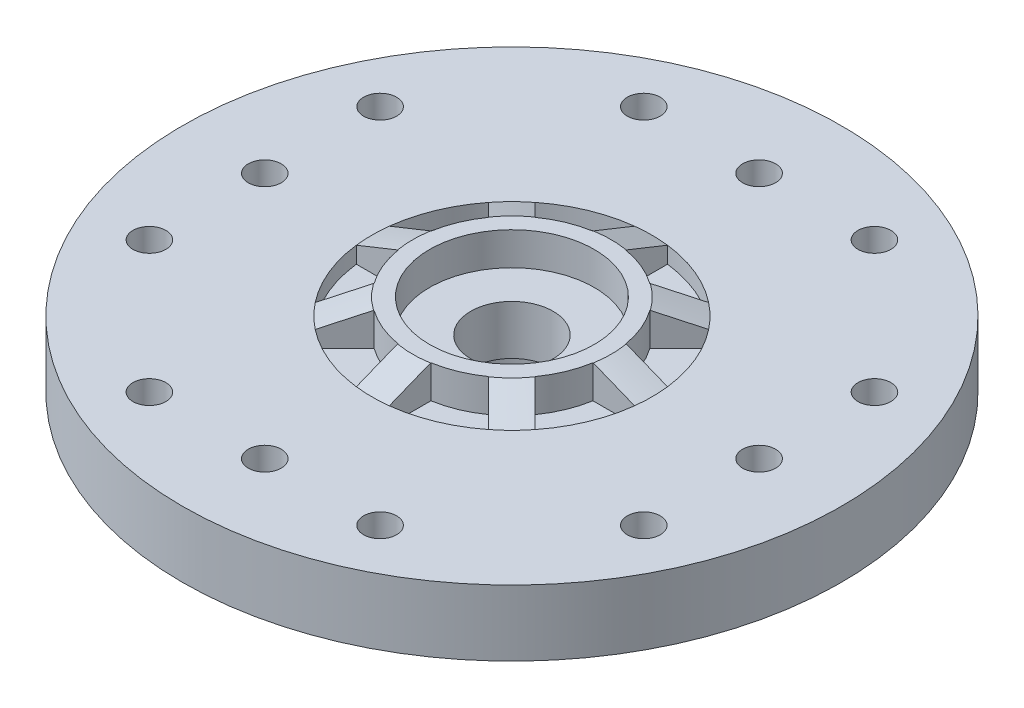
ISO-10303-21;
HEADER;
FILE_DESCRIPTION(('STEP AP214'),'2;1');
FILE_NAME('part.step','',(''),(''),'','','');
FILE_SCHEMA(('AUTOMOTIVE_DESIGN { 1 0 10303 214 1 1 1 1 }'));
ENDSEC;
DATA;
#1=APPLICATION_CONTEXT('core data for automotive mechanical design processes');
#2=APPLICATION_PROTOCOL_DEFINITION('international standard','automotive_design',2000,#1);
#3=PRODUCT_CONTEXT('',#1,'mechanical');
#4=PRODUCT('Part','Part','',(#3));
#5=PRODUCT_RELATED_PRODUCT_CATEGORY('part','',(#4));
#6=PRODUCT_DEFINITION_FORMATION('','',#4);
#7=PRODUCT_DEFINITION_CONTEXT('part definition',#1,'design');
#8=PRODUCT_DEFINITION('design','',#6,#7);
#9=PRODUCT_DEFINITION_SHAPE('','',#8);
#10=(LENGTH_UNIT() NAMED_UNIT(*) SI_UNIT(.MILLI.,.METRE.));
#11=(NAMED_UNIT(*) PLANE_ANGLE_UNIT() SI_UNIT($,.RADIAN.));
#12=(NAMED_UNIT(*) SI_UNIT($,.STERADIAN.) SOLID_ANGLE_UNIT());
#13=UNCERTAINTY_MEASURE_WITH_UNIT(LENGTH_MEASURE(1.E-05),#10,'distance_accuracy_value','');
#14=(GEOMETRIC_REPRESENTATION_CONTEXT(3) GLOBAL_UNCERTAINTY_ASSIGNED_CONTEXT((#13)) GLOBAL_UNIT_ASSIGNED_CONTEXT((#10,
#11,#12)) REPRESENTATION_CONTEXT('',''));
#15=CARTESIAN_POINT('',(0.,0.,0.));
#16=DIRECTION('',(0.,0.,1.));
#17=DIRECTION('',(1.,0.,0.));
#18=AXIS2_PLACEMENT_3D('',#15,#16,#17);
#19=CARTESIAN_POINT('',(0.,1.5,0.));
#20=DIRECTION('',(0.,1.,0.));
#21=DIRECTION('',(0.,0.,1.));
#22=AXIS2_PLACEMENT_3D('',#19,#20,#21);
#23=CYLINDRICAL_SURFACE('',#22,4.25);
#24=DIRECTION('',(0.,-1.,0.));
#25=VECTOR('',#24,1.);
#26=CARTESIAN_POINT('',(-3.33788748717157,2.5,-2.6307807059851));
#27=LINE('',#26,#25);
#28=CARTESIAN_POINT('',(-3.33788748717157,2.,-2.6307807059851));
#29=VERTEX_POINT('',#28);
#30=CARTESIAN_POINT('',(-3.33788748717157,1.5,-2.6307807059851));
#31=VERTEX_POINT('',#30);
#32=EDGE_CURVE('E351',#29,#31,#27,.T.);
#33=ORIENTED_EDGE('',*,*,#32,.F.);
#34=CARTESIAN_POINT('',(0.,2.,0.));
#35=DIRECTION('',(0.,1.,0.));
#36=DIRECTION('',(0.,0.,1.));
#37=AXIS2_PLACEMENT_3D('',#34,#35,#36);
#38=CIRCLE('',#37,4.25);
#39=CARTESIAN_POINT('',(-4.22048575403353,2.,-0.500000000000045));
#40=VERTEX_POINT('',#39);
#41=EDGE_CURVE('E704',#29,#40,#38,.T.);
#42=ORIENTED_EDGE('',*,*,#41,.T.);
#43=DIRECTION('',(0.,-1.,0.));
#44=VECTOR('',#43,1.);
#45=CARTESIAN_POINT('',(-4.22048575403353,2.5,-0.500000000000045));
#46=LINE('',#45,#44);
#47=CARTESIAN_POINT('',(-4.22048575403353,1.5,-0.500000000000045));
#48=VERTEX_POINT('',#47);
#49=EDGE_CURVE('E949',#40,#48,#46,.T.);
#50=ORIENTED_EDGE('',*,*,#49,.T.);
#51=CARTESIAN_POINT('',(0.,1.5,0.));
#52=DIRECTION('',(0.,1.,0.));
#53=DIRECTION('',(0.,0.,1.));
#54=AXIS2_PLACEMENT_3D('',#51,#52,#53);
#55=CIRCLE('',#54,4.25);
#56=EDGE_CURVE('E969',#31,#48,#55,.T.);
#57=ORIENTED_EDGE('',*,*,#56,.F.);
#58=EDGE_LOOP('',(#33,#42,#50,#57));
#59=FACE_BOUND('',#58,.T.);
#60=ADVANCED_FACE('F50',(#59),#23,.F.);
#61=DIRECTION('',(0.,-1.,0.));
#62=VECTOR('',#61,1.);
#63=CARTESIAN_POINT('',(-4.22048575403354,2.5,0.499999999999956));
#64=LINE('',#63,#62);
#65=CARTESIAN_POINT('',(-4.22048575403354,2.,0.499999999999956));
#66=VERTEX_POINT('',#65);
#67=CARTESIAN_POINT('',(-4.22048575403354,1.5,0.499999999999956));
#68=VERTEX_POINT('',#67);
#69=EDGE_CURVE('E948',#66,#68,#64,.T.);
#70=ORIENTED_EDGE('',*,*,#69,.F.);
#71=CARTESIAN_POINT('',(-3.33788748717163,2.,2.63078070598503));
#72=VERTEX_POINT('',#71);
#73=EDGE_CURVE('E1047',#66,#72,#38,.T.);
#74=ORIENTED_EDGE('',*,*,#73,.T.);
#75=DIRECTION('',(0.,-1.,0.));
#76=VECTOR('',#75,1.);
#77=CARTESIAN_POINT('',(-3.33788748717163,2.5,2.63078070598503));
#78=LINE('',#77,#76);
#79=CARTESIAN_POINT('',(-3.33788748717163,1.5,2.63078070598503));
#80=VERTEX_POINT('',#79);
#81=EDGE_CURVE('E933',#72,#80,#78,.T.);
#82=ORIENTED_EDGE('',*,*,#81,.T.);
#83=EDGE_CURVE('E971',#68,#80,#55,.T.);
#84=ORIENTED_EDGE('',*,*,#83,.F.);
#85=EDGE_LOOP('',(#70,#74,#82,#84));
#86=FACE_BOUND('',#85,.T.);
#87=ADVANCED_FACE('F666',(#86),#23,.F.);
#88=DIRECTION('',(0.,-1.,0.));
#89=VECTOR('',#88,1.);
#90=CARTESIAN_POINT('',(-2.63078070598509,2.5,3.33788748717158));
#91=LINE('',#90,#89);
#92=CARTESIAN_POINT('',(-2.63078070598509,2.,3.33788748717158));
#93=VERTEX_POINT('',#92);
#94=CARTESIAN_POINT('',(-2.63078070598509,1.5,3.33788748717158));
#95=VERTEX_POINT('',#94);
#96=EDGE_CURVE('E934',#93,#95,#91,.T.);
#97=ORIENTED_EDGE('',*,*,#96,.F.);
#98=CARTESIAN_POINT('',(-0.50000000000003,2.,4.22048575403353));
#99=VERTEX_POINT('',#98);
#100=EDGE_CURVE('E359',#93,#99,#38,.T.);
#101=ORIENTED_EDGE('',*,*,#100,.T.);
#102=DIRECTION('',(0.,-1.,0.));
#103=VECTOR('',#102,1.);
#104=CARTESIAN_POINT('',(-0.50000000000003,2.5,4.22048575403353));
#105=LINE('',#104,#103);
#106=CARTESIAN_POINT('',(-0.50000000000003,1.5,4.22048575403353));
#107=VERTEX_POINT('',#106);
#108=EDGE_CURVE('E918',#99,#107,#105,.T.);
#109=ORIENTED_EDGE('',*,*,#108,.T.);
#110=EDGE_CURVE('E370',#95,#107,#55,.T.);
#111=ORIENTED_EDGE('',*,*,#110,.F.);
#112=EDGE_LOOP('',(#97,#101,#109,#111));
#113=FACE_BOUND('',#112,.T.);
#114=ADVANCED_FACE('F673',(#113),#23,.F.);
#115=DIRECTION('',(0.,-1.,0.));
#116=VECTOR('',#115,1.);
#117=CARTESIAN_POINT('',(0.499999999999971,2.5,4.22048575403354));
#118=LINE('',#117,#116);
#119=CARTESIAN_POINT('',(0.499999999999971,2.,4.22048575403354));
#120=VERTEX_POINT('',#119);
#121=CARTESIAN_POINT('',(0.499999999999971,1.5,4.22048575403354));
#122=VERTEX_POINT('',#121);
#123=EDGE_CURVE('E919',#120,#122,#118,.T.);
#124=ORIENTED_EDGE('',*,*,#123,.F.);
#125=CARTESIAN_POINT('',(2.63078070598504,2.,3.33788748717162));
#126=VERTEX_POINT('',#125);
#127=EDGE_CURVE('E347',#120,#126,#38,.T.);
#128=ORIENTED_EDGE('',*,*,#127,.T.);
#129=DIRECTION('',(0.,-1.,0.));
#130=VECTOR('',#129,1.);
#131=CARTESIAN_POINT('',(2.63078070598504,2.5,3.33788748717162));
#132=LINE('',#131,#130);
#133=CARTESIAN_POINT('',(2.63078070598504,1.5,3.33788748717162));
#134=VERTEX_POINT('',#133);
#135=EDGE_CURVE('E901',#126,#134,#132,.T.);
#136=ORIENTED_EDGE('',*,*,#135,.T.);
#137=EDGE_CURVE('E365',#122,#134,#55,.T.);
#138=ORIENTED_EDGE('',*,*,#137,.F.);
#139=EDGE_LOOP('',(#124,#128,#136,#138));
#140=FACE_BOUND('',#139,.T.);
#141=ADVANCED_FACE('F1070',(#140),#23,.F.);
#142=DIRECTION('',(0.,-1.,0.));
#143=VECTOR('',#142,1.);
#144=CARTESIAN_POINT('',(3.33788748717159,2.5,2.63078070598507));
#145=LINE('',#144,#143);
#146=CARTESIAN_POINT('',(3.33788748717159,2.,2.63078070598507));
#147=VERTEX_POINT('',#146);
#148=CARTESIAN_POINT('',(3.33788748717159,1.5,2.63078070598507));
#149=VERTEX_POINT('',#148);
#150=EDGE_CURVE('E902',#147,#149,#145,.T.);
#151=ORIENTED_EDGE('',*,*,#150,.F.);
#152=CARTESIAN_POINT('',(4.22048575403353,2.,0.500000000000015));
#153=VERTEX_POINT('',#152);
#154=EDGE_CURVE('E371',#147,#153,#38,.T.);
#155=ORIENTED_EDGE('',*,*,#154,.T.);
#156=DIRECTION('',(0.,-1.,0.));
#157=VECTOR('',#156,1.);
#158=CARTESIAN_POINT('',(4.22048575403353,2.5,0.500000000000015));
#159=LINE('',#158,#157);
#160=CARTESIAN_POINT('',(4.22048575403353,1.5,0.500000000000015));
#161=VERTEX_POINT('',#160);
#162=EDGE_CURVE('E887',#153,#161,#159,.T.);
#163=ORIENTED_EDGE('',*,*,#162,.T.);
#164=EDGE_CURVE('E366',#149,#161,#55,.T.);
#165=ORIENTED_EDGE('',*,*,#164,.F.);
#166=EDGE_LOOP('',(#151,#155,#163,#165));
#167=FACE_BOUND('',#166,.T.);
#168=ADVANCED_FACE('F1363',(#167),#23,.F.);
#169=DIRECTION('',(0.,-1.,0.));
#170=VECTOR('',#169,1.);
#171=CARTESIAN_POINT('',(4.22048575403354,2.5,-0.499999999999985));
#172=LINE('',#171,#170);
#173=CARTESIAN_POINT('',(4.22048575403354,2.,-0.499999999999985));
#174=VERTEX_POINT('',#173);
#175=CARTESIAN_POINT('',(4.22048575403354,1.5,-0.499999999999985));
#176=VERTEX_POINT('',#175);
#177=EDGE_CURVE('E886',#174,#176,#172,.T.);
#178=ORIENTED_EDGE('',*,*,#177,.F.);
#179=CARTESIAN_POINT('',(3.33788748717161,2.,-2.63078070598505));
#180=VERTEX_POINT('',#179);
#181=EDGE_CURVE('E1024',#174,#180,#38,.T.);
#182=ORIENTED_EDGE('',*,*,#181,.T.);
#183=DIRECTION('',(0.,-1.,0.));
#184=VECTOR('',#183,1.);
#185=CARTESIAN_POINT('',(3.33788748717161,2.5,-2.63078070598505));
#186=LINE('',#185,#184);
#187=CARTESIAN_POINT('',(3.33788748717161,1.5,-2.63078070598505));
#188=VERTEX_POINT('',#187);
#189=EDGE_CURVE('E873',#180,#188,#186,.T.);
#190=ORIENTED_EDGE('',*,*,#189,.T.);
#191=EDGE_CURVE('E1097',#176,#188,#55,.T.);
#192=ORIENTED_EDGE('',*,*,#191,.F.);
#193=EDGE_LOOP('',(#178,#182,#190,#192));
#194=FACE_BOUND('',#193,.T.);
#195=ADVANCED_FACE('F691',(#194),#23,.F.);
#196=DIRECTION('',(0.,-1.,0.));
#197=VECTOR('',#196,1.);
#198=CARTESIAN_POINT('',(2.63078070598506,2.5,-3.3378874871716));
#199=LINE('',#198,#197);
#200=CARTESIAN_POINT('',(2.63078070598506,2.,-3.3378874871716));
#201=VERTEX_POINT('',#200);
#202=CARTESIAN_POINT('',(2.63078070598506,1.5,-3.3378874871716));
#203=VERTEX_POINT('',#202);
#204=EDGE_CURVE('E874',#201,#203,#199,.T.);
#205=ORIENTED_EDGE('',*,*,#204,.F.);
#206=CARTESIAN_POINT('',(0.5,2.,-4.22048575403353));
#207=VERTEX_POINT('',#206);
#208=EDGE_CURVE('E703',#201,#207,#38,.T.);
#209=ORIENTED_EDGE('',*,*,#208,.T.);
#210=DIRECTION('',(0.,-1.,0.));
#211=VECTOR('',#210,1.);
#212=CARTESIAN_POINT('',(0.5,2.5,-4.22048575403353));
#213=LINE('',#212,#211);
#214=CARTESIAN_POINT('',(0.5,1.5,-4.22048575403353));
#215=VERTEX_POINT('',#214);
#216=EDGE_CURVE('E858',#207,#215,#213,.T.);
#217=ORIENTED_EDGE('',*,*,#216,.T.);
#218=EDGE_CURVE('E973',#203,#215,#55,.T.);
#219=ORIENTED_EDGE('',*,*,#218,.F.);
#220=EDGE_LOOP('',(#205,#209,#217,#219));
#221=FACE_BOUND('',#220,.T.);
#222=ADVANCED_FACE('F683',(#221),#23,.F.);
#223=CARTESIAN_POINT('',(-0.5,2.,-4.22048575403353));
#224=VERTEX_POINT('',#223);
#225=CARTESIAN_POINT('',(-2.63078070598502,2.,-3.33788748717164));
#226=VERTEX_POINT('',#225);
#227=EDGE_CURVE('E696',#224,#226,#38,.T.);
#228=ORIENTED_EDGE('',*,*,#227,.T.);
#229=DIRECTION('',(0.,-1.,0.));
#230=VECTOR('',#229,1.);
#231=CARTESIAN_POINT('',(-2.63078070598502,2.5,-3.33788748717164));
#232=LINE('',#231,#230);
#233=CARTESIAN_POINT('',(-2.63078070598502,1.5,-3.33788748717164));
#234=VERTEX_POINT('',#233);
#235=EDGE_CURVE('E343',#226,#234,#232,.T.);
#236=ORIENTED_EDGE('',*,*,#235,.T.);
#237=CARTESIAN_POINT('',(-0.5,1.5,-4.22048575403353));
#238=VERTEX_POINT('',#237);
#239=EDGE_CURVE('E968',#238,#234,#55,.T.);
#240=ORIENTED_EDGE('',*,*,#239,.F.);
#241=DIRECTION('',(0.,-1.,0.));
#242=VECTOR('',#241,1.);
#243=CARTESIAN_POINT('',(-0.5,2.5,-4.22048575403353));
#244=LINE('',#243,#242);
#245=EDGE_CURVE('E697',#224,#238,#244,.T.);
#246=ORIENTED_EDGE('',*,*,#245,.F.);
#247=EDGE_LOOP('',(#228,#236,#240,#246));
#248=FACE_BOUND('',#247,.T.);
#249=ADVANCED_FACE('F668',(#248),#23,.F.);
#250=CARTESIAN_POINT('',(0.,1.5,0.));
#251=DIRECTION('',(0.,1.,0.));
#252=DIRECTION('',(0.,0.,1.));
#253=AXIS2_PLACEMENT_3D('',#250,#251,#252);
#254=PLANE('',#253);
#255=DIRECTION('',(0.,0.,-1.));
#256=VECTOR('',#255,1.);
#257=CARTESIAN_POINT('',(0.5,1.5,-2.95803989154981));
#258=LINE('',#257,#256);
#259=CARTESIAN_POINT('',(0.5,1.5,-2.95803989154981));
#260=VERTEX_POINT('',#259);
#261=EDGE_CURVE('E854',#260,#215,#258,.T.);
#262=ORIENTED_EDGE('',*,*,#261,.F.);
#263=CARTESIAN_POINT('',(0.,1.5,0.));
#264=DIRECTION('',(0.,1.,0.));
#265=DIRECTION('',(0.,0.,1.));
#266=AXIS2_PLACEMENT_3D('',#263,#264,#265);
#267=CIRCLE('',#266,3.);
#268=CARTESIAN_POINT('',(1.73809667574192,1.5,-2.44520345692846));
#269=VERTEX_POINT('',#268);
#270=EDGE_CURVE('E850',#269,#260,#267,.T.);
#271=ORIENTED_EDGE('',*,*,#270,.F.);
#272=DIRECTION('',(-0.707106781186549,0.,0.707106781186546));
#273=VECTOR('',#272,1.);
#274=CARTESIAN_POINT('',(1.73809667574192,1.5,-2.44520345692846));
#275=LINE('',#274,#273);
#276=EDGE_CURVE('E843',#203,#269,#275,.T.);
#277=ORIENTED_EDGE('',*,*,#276,.F.);
#278=ORIENTED_EDGE('',*,*,#218,.T.);
#279=EDGE_LOOP('',(#262,#271,#277,#278));
#280=FACE_BOUND('',#279,.T.);
#281=ADVANCED_FACE('F677',(#280),#254,.T.);
#282=DIRECTION('',(0.707106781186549,0.,-0.707106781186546));
#283=VECTOR('',#282,1.);
#284=CARTESIAN_POINT('',(2.44520345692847,1.5,-1.73809667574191));
#285=LINE('',#284,#283);
#286=CARTESIAN_POINT('',(2.44520345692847,1.5,-1.73809667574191));
#287=VERTEX_POINT('',#286);
#288=EDGE_CURVE('E841',#287,#188,#285,.T.);
#289=ORIENTED_EDGE('',*,*,#288,.F.);
#290=CARTESIAN_POINT('',(0.,1.5,0.));
#291=DIRECTION('',(0.,1.,0.));
#292=DIRECTION('',(0.,0.,1.));
#293=AXIS2_PLACEMENT_3D('',#290,#291,#292);
#294=CIRCLE('',#293,3.);
#295=CARTESIAN_POINT('',(2.95803989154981,1.5,-0.49999999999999));
#296=VERTEX_POINT('',#295);
#297=EDGE_CURVE('E839',#296,#287,#294,.T.);
#298=ORIENTED_EDGE('',*,*,#297,.F.);
#299=DIRECTION('',(-1.,0.,0.));
#300=VECTOR('',#299,1.);
#301=CARTESIAN_POINT('',(2.95803989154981,1.5,-0.49999999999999));
#302=LINE('',#301,#300);
#303=EDGE_CURVE('E834',#176,#296,#302,.T.);
#304=ORIENTED_EDGE('',*,*,#303,.F.);
#305=ORIENTED_EDGE('',*,*,#191,.T.);
#306=EDGE_LOOP('',(#289,#298,#304,#305));
#307=FACE_BOUND('',#306,.T.);
#308=ADVANCED_FACE('F686',(#307),#254,.T.);
#309=DIRECTION('',(1.,0.,0.));
#310=VECTOR('',#309,1.);
#311=CARTESIAN_POINT('',(2.95803989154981,1.5,0.50000000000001));
#312=LINE('',#311,#310);
#313=CARTESIAN_POINT('',(2.95803989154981,1.5,0.50000000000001));
#314=VERTEX_POINT('',#313);
#315=EDGE_CURVE('E835',#314,#161,#312,.T.);
#316=ORIENTED_EDGE('',*,*,#315,.F.);
#317=CARTESIAN_POINT('',(0.,1.5,0.));
#318=DIRECTION('',(0.,1.,0.));
#319=DIRECTION('',(0.,0.,1.));
#320=AXIS2_PLACEMENT_3D('',#317,#318,#319);
#321=CIRCLE('',#320,3.);
#322=CARTESIAN_POINT('',(2.44520345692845,1.5,1.73809667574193));
#323=VERTEX_POINT('',#322);
#324=EDGE_CURVE('E827',#323,#314,#321,.T.);
#325=ORIENTED_EDGE('',*,*,#324,.F.);
#326=DIRECTION('',(-0.707106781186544,0.,-0.707106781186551));
#327=VECTOR('',#326,1.);
#328=CARTESIAN_POINT('',(2.44520345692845,1.5,1.73809667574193));
#329=LINE('',#328,#327);
#330=EDGE_CURVE('E826',#149,#323,#329,.T.);
#331=ORIENTED_EDGE('',*,*,#330,.F.);
#332=ORIENTED_EDGE('',*,*,#164,.T.);
#333=EDGE_LOOP('',(#316,#325,#331,#332));
#334=FACE_BOUND('',#333,.T.);
#335=ADVANCED_FACE('F1134',(#334),#254,.T.);
#336=DIRECTION('',(0.707106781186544,0.,0.707106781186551));
#337=VECTOR('',#336,1.);
#338=CARTESIAN_POINT('',(1.7380966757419,1.5,2.44520345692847));
#339=LINE('',#338,#337);
#340=CARTESIAN_POINT('',(1.7380966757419,1.5,2.44520345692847));
#341=VERTEX_POINT('',#340);
#342=EDGE_CURVE('E823',#341,#134,#339,.T.);
#343=ORIENTED_EDGE('',*,*,#342,.F.);
#344=CARTESIAN_POINT('',(0.,1.5,0.));
#345=DIRECTION('',(0.,1.,0.));
#346=DIRECTION('',(0.,0.,1.));
#347=AXIS2_PLACEMENT_3D('',#344,#345,#346);
#348=CIRCLE('',#347,3.);
#349=CARTESIAN_POINT('',(0.49999999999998,1.5,2.95803989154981));
#350=VERTEX_POINT('',#349);
#351=EDGE_CURVE('E817',#350,#341,#348,.T.);
#352=ORIENTED_EDGE('',*,*,#351,.F.);
#353=DIRECTION('',(0.,0.,-1.));
#354=VECTOR('',#353,1.);
#355=CARTESIAN_POINT('',(0.49999999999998,1.5,2.95803989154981));
#356=LINE('',#355,#354);
#357=EDGE_CURVE('E820',#122,#350,#356,.T.);
#358=ORIENTED_EDGE('',*,*,#357,.F.);
#359=ORIENTED_EDGE('',*,*,#137,.T.);
#360=EDGE_LOOP('',(#343,#352,#358,#359));
#361=FACE_BOUND('',#360,.T.);
#362=ADVANCED_FACE('F1073',(#361),#254,.T.);
#363=DIRECTION('',(0.,0.,1.));
#364=VECTOR('',#363,1.);
#365=CARTESIAN_POINT('',(-0.500000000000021,1.5,2.9580398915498));
#366=LINE('',#365,#364);
#367=CARTESIAN_POINT('',(-0.500000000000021,1.5,2.9580398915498));
#368=VERTEX_POINT('',#367);
#369=EDGE_CURVE('E815',#368,#107,#366,.T.);
#370=ORIENTED_EDGE('',*,*,#369,.F.);
#371=CARTESIAN_POINT('',(0.,1.5,0.));
#372=DIRECTION('',(0.,1.,0.));
#373=DIRECTION('',(0.,0.,1.));
#374=AXIS2_PLACEMENT_3D('',#371,#372,#373);
#375=CIRCLE('',#374,3.);
#376=CARTESIAN_POINT('',(-1.73809667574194,1.5,2.44520345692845));
#377=VERTEX_POINT('',#376);
#378=EDGE_CURVE('E813',#377,#368,#375,.T.);
#379=ORIENTED_EDGE('',*,*,#378,.F.);
#380=DIRECTION('',(0.707106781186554,0.,-0.707106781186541));
#381=VECTOR('',#380,1.);
#382=CARTESIAN_POINT('',(-1.73809667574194,1.5,2.44520345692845));
#383=LINE('',#382,#381);
#384=EDGE_CURVE('E810',#95,#377,#383,.T.);
#385=ORIENTED_EDGE('',*,*,#384,.F.);
#386=ORIENTED_EDGE('',*,*,#110,.T.);
#387=EDGE_LOOP('',(#370,#379,#385,#386));
#388=FACE_BOUND('',#387,.T.);
#389=ADVANCED_FACE('F987',(#388),#254,.T.);
#390=DIRECTION('',(-0.707106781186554,0.,0.707106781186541));
#391=VECTOR('',#390,1.);
#392=CARTESIAN_POINT('',(-2.44520345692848,1.5,1.73809667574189));
#393=LINE('',#392,#391);
#394=CARTESIAN_POINT('',(-2.44520345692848,1.5,1.73809667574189));
#395=VERTEX_POINT('',#394);
#396=EDGE_CURVE('E802',#395,#80,#393,.T.);
#397=ORIENTED_EDGE('',*,*,#396,.F.);
#398=CARTESIAN_POINT('',(0.,1.5,0.));
#399=DIRECTION('',(0.,1.,0.));
#400=DIRECTION('',(0.,0.,1.));
#401=AXIS2_PLACEMENT_3D('',#398,#399,#400);
#402=CIRCLE('',#401,3.);
#403=CARTESIAN_POINT('',(-2.95803989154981,1.5,0.499999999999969));
#404=VERTEX_POINT('',#403);
#405=EDGE_CURVE('E801',#404,#395,#402,.T.);
#406=ORIENTED_EDGE('',*,*,#405,.F.);
#407=DIRECTION('',(1.,0.,0.));
#408=VECTOR('',#407,1.);
#409=CARTESIAN_POINT('',(-2.95803989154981,1.5,0.499999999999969));
#410=LINE('',#409,#408);
#411=EDGE_CURVE('E798',#68,#404,#410,.T.);
#412=ORIENTED_EDGE('',*,*,#411,.F.);
#413=ORIENTED_EDGE('',*,*,#83,.T.);
#414=EDGE_LOOP('',(#397,#406,#412,#413));
#415=FACE_BOUND('',#414,.T.);
#416=ADVANCED_FACE('F1090',(#415),#254,.T.);
#417=DIRECTION('',(-1.,0.,0.));
#418=VECTOR('',#417,1.);
#419=CARTESIAN_POINT('',(-2.9580398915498,1.5,-0.500000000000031));
#420=LINE('',#419,#418);
#421=CARTESIAN_POINT('',(-2.9580398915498,1.5,-0.500000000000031));
#422=VERTEX_POINT('',#421);
#423=EDGE_CURVE('E796',#422,#48,#420,.T.);
#424=ORIENTED_EDGE('',*,*,#423,.F.);
#425=CARTESIAN_POINT('',(0.,1.5,0.));
#426=DIRECTION('',(0.,1.,0.));
#427=DIRECTION('',(0.,0.,1.));
#428=AXIS2_PLACEMENT_3D('',#425,#426,#427);
#429=CIRCLE('',#428,3.);
#430=CARTESIAN_POINT('',(-2.44520345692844,1.5,-1.73809667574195));
#431=VERTEX_POINT('',#430);
#432=EDGE_CURVE('E791',#431,#422,#429,.T.);
#433=ORIENTED_EDGE('',*,*,#432,.F.);
#434=DIRECTION('',(0.707106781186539,0.,0.707106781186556));
#435=VECTOR('',#434,1.);
#436=CARTESIAN_POINT('',(-2.44520345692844,1.5,-1.73809667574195));
#437=LINE('',#436,#435);
#438=EDGE_CURVE('E787',#31,#431,#437,.T.);
#439=ORIENTED_EDGE('',*,*,#438,.F.);
#440=ORIENTED_EDGE('',*,*,#56,.T.);
#441=EDGE_LOOP('',(#424,#433,#439,#440));
#442=FACE_BOUND('',#441,.T.);
#443=ADVANCED_FACE('F970',(#442),#254,.T.);
#444=DIRECTION('',(0.,0.,1.));
#445=VECTOR('',#444,1.);
#446=CARTESIAN_POINT('',(-0.5,1.5,-2.95803989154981));
#447=LINE('',#446,#445);
#448=CARTESIAN_POINT('',(-0.5,1.5,-2.95803989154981));
#449=VERTEX_POINT('',#448);
#450=EDGE_CURVE('E337',#238,#449,#447,.T.);
#451=ORIENTED_EDGE('',*,*,#450,.F.);
#452=ORIENTED_EDGE('',*,*,#239,.T.);
#453=DIRECTION('',(-0.707106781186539,0.,-0.707106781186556));
#454=VECTOR('',#453,1.);
#455=CARTESIAN_POINT('',(-1.73809667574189,1.5,-2.44520345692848));
#456=LINE('',#455,#454);
#457=CARTESIAN_POINT('',(-1.73809667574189,1.5,-2.44520345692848));
#458=VERTEX_POINT('',#457);
#459=EDGE_CURVE('E789',#458,#234,#456,.T.);
#460=ORIENTED_EDGE('',*,*,#459,.F.);
#461=CARTESIAN_POINT('',(0.,1.5,0.));
#462=DIRECTION('',(0.,1.,0.));
#463=DIRECTION('',(0.,0.,1.));
#464=AXIS2_PLACEMENT_3D('',#461,#462,#463);
#465=CIRCLE('',#464,3.);
#466=EDGE_CURVE('E338',#449,#458,#465,.T.);
#467=ORIENTED_EDGE('',*,*,#466,.F.);
#468=EDGE_LOOP('',(#451,#452,#460,#467));
#469=FACE_BOUND('',#468,.T.);
#470=ADVANCED_FACE('F1044',(#469),#254,.T.);
#471=CARTESIAN_POINT('',(0.,1.5,0.));
#472=DIRECTION('',(0.,1.,0.));
#473=DIRECTION('',(0.,0.,1.));
#474=AXIS2_PLACEMENT_3D('',#471,#472,#473);
#475=CIRCLE('',#474,1.25);
#476=CARTESIAN_POINT('',(0.,1.5,1.25));
#477=VERTEX_POINT('',#476);
#478=EDGE_CURVE('E358',#477,#477,#475,.T.);
#479=ORIENTED_EDGE('',*,*,#478,.F.);
#480=EDGE_LOOP('',(#479));
#481=FACE_BOUND('',#480,.T.);
#482=CARTESIAN_POINT('',(0.,1.5,0.));
#483=DIRECTION('',(0.,1.,0.));
#484=DIRECTION('',(0.,0.,1.));
#485=AXIS2_PLACEMENT_3D('',#482,#483,#484);
#486=CIRCLE('',#485,2.5);
#487=CARTESIAN_POINT('',(0.,1.5,2.5));
#488=VERTEX_POINT('',#487);
#489=EDGE_CURVE('E389',#488,#488,#486,.F.);
#490=ORIENTED_EDGE('',*,*,#489,.F.);
#491=EDGE_LOOP('',(#490));
#492=FACE_BOUND('',#491,.T.);
#493=ADVANCED_FACE('F687',(#481,#492),#254,.T.);
#494=CARTESIAN_POINT('',(0.,2.,0.));
#495=DIRECTION('',(0.,-1.,0.));
#496=DIRECTION('',(0.,0.,-1.));
#497=AXIS2_PLACEMENT_3D('',#494,#495,#496);
#498=CYLINDRICAL_SURFACE('',#497,1.25);
#499=CARTESIAN_POINT('',(0.,0.,0.));
#500=DIRECTION('',(0.,1.,0.));
#501=DIRECTION('',(0.,0.,1.));
#502=AXIS2_PLACEMENT_3D('',#499,#500,#501);
#503=CIRCLE('',#502,1.25);
#504=CARTESIAN_POINT('',(0.,0.,1.25));
#505=VERTEX_POINT('',#504);
#506=EDGE_CURVE('E384',#505,#505,#503,.T.);
#507=ORIENTED_EDGE('',*,*,#506,.F.);
#508=EDGE_LOOP('',(#507));
#509=FACE_BOUND('',#508,.T.);
#510=ORIENTED_EDGE('',*,*,#478,.T.);
#511=EDGE_LOOP('',(#510));
#512=FACE_BOUND('',#511,.T.);
#513=ADVANCED_FACE('F1309',(#509,#512),#498,.F.);
#514=CARTESIAN_POINT('',(0.,0.,0.));
#515=DIRECTION('',(0.,1.,0.));
#516=DIRECTION('',(0.,0.,1.));
#517=AXIS2_PLACEMENT_3D('',#514,#515,#516);
#518=PLANE('',#517);
#519=ORIENTED_EDGE('',*,*,#506,.T.);
#520=EDGE_LOOP('',(#519));
#521=FACE_BOUND('',#520,.T.);
#522=CARTESIAN_POINT('',(0.,0.,0.));
#523=DIRECTION('',(0.,-1.,0.));
#524=DIRECTION('',(0.,0.,-1.));
#525=AXIS2_PLACEMENT_3D('',#522,#523,#524);
#526=CIRCLE('',#525,2.25);
#527=CARTESIAN_POINT('',(0.,0.,-2.25));
#528=VERTEX_POINT('',#527);
#529=EDGE_CURVE('E362',#528,#528,#526,.T.);
#530=ORIENTED_EDGE('',*,*,#529,.T.);
#531=EDGE_LOOP('',(#530));
#532=FACE_BOUND('',#531,.T.);
#533=ADVANCED_FACE('F1315',(#521,#532),#518,.F.);
#534=CARTESIAN_POINT('',(0.,2.,0.));
#535=DIRECTION('',(0.,1.,0.));
#536=DIRECTION('',(0.,0.,1.));
#537=AXIS2_PLACEMENT_3D('',#534,#535,#536);
#538=PLANE('',#537);
#539=CARTESIAN_POINT('',(-7.49999999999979,2.,-3.49999999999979));
#540=DIRECTION('',(0.,1.,0.));
#541=DIRECTION('',(0.,0.,1.));
#542=AXIS2_PLACEMENT_3D('',#539,#540,#541);
#543=CIRCLE('',#542,0.500000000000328);
#544=CARTESIAN_POINT('',(-7.49999999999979,2.,-2.99999999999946));
#545=VERTEX_POINT('',#544);
#546=EDGE_CURVE('E1285',#545,#545,#543,.T.);
#547=ORIENTED_EDGE('',*,*,#546,.F.);
#548=EDGE_LOOP('',(#547));
#549=FACE_BOUND('',#548,.T.);
#550=CARTESIAN_POINT('',(-7.49999999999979,2.,3.50000000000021));
#551=DIRECTION('',(0.,1.,0.));
#552=DIRECTION('',(0.,0.,1.));
#553=AXIS2_PLACEMENT_3D('',#550,#551,#552);
#554=CIRCLE('',#553,0.500000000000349);
#555=CARTESIAN_POINT('',(-7.49999999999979,2.,4.00000000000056));
#556=VERTEX_POINT('',#555);
#557=EDGE_CURVE('E1274',#556,#556,#554,.T.);
#558=ORIENTED_EDGE('',*,*,#557,.F.);
#559=EDGE_LOOP('',(#558));
#560=FACE_BOUND('',#559,.T.);
#561=CARTESIAN_POINT('',(-7.49999999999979,2.,2.10866607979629E-13));
#562=DIRECTION('',(0.,1.,0.));
#563=DIRECTION('',(0.,0.,1.));
#564=AXIS2_PLACEMENT_3D('',#561,#562,#563);
#565=CIRCLE('',#564,0.500000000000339);
#566=CARTESIAN_POINT('',(-7.49999999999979,2.,0.50000000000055));
#567=VERTEX_POINT('',#566);
#568=EDGE_CURVE('E1252',#567,#567,#565,.T.);
#569=ORIENTED_EDGE('',*,*,#568,.F.);
#570=EDGE_LOOP('',(#569));
#571=FACE_BOUND('',#570,.T.);
#572=CARTESIAN_POINT('',(7.50000000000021,2.,3.49999999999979));
#573=DIRECTION('',(0.,1.,0.));
#574=DIRECTION('',(0.,0.,1.));
#575=AXIS2_PLACEMENT_3D('',#572,#573,#574);
#576=CIRCLE('',#575,0.500000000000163);
#577=CARTESIAN_POINT('',(7.50000000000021,2.,3.99999999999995));
#578=VERTEX_POINT('',#577);
#579=EDGE_CURVE('E1233',#578,#578,#576,.T.);
#580=ORIENTED_EDGE('',*,*,#579,.F.);
#581=EDGE_LOOP('',(#580));
#582=FACE_BOUND('',#581,.T.);
#583=CARTESIAN_POINT('',(4.23570186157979E-13,2.,7.5));
#584=DIRECTION('',(0.,1.,0.));
#585=DIRECTION('',(0.,0.,1.));
#586=AXIS2_PLACEMENT_3D('',#583,#584,#585);
#587=CIRCLE('',#586,0.500000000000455);
#588=CARTESIAN_POINT('',(4.23570186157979E-13,2.,8.00000000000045));
#589=VERTEX_POINT('',#588);
#590=EDGE_CURVE('E1257',#589,#589,#587,.T.);
#591=ORIENTED_EDGE('',*,*,#590,.F.);
#592=EDGE_LOOP('',(#591));
#593=FACE_BOUND('',#592,.T.);
#594=CARTESIAN_POINT('',(3.50000000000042,2.,7.5));
#595=DIRECTION('',(0.,1.,0.));
#596=DIRECTION('',(0.,0.,1.));
#597=AXIS2_PLACEMENT_3D('',#594,#595,#596);
#598=CIRCLE('',#597,0.500000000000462);
#599=CARTESIAN_POINT('',(3.50000000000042,2.,8.00000000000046));
#600=VERTEX_POINT('',#599);
#601=EDGE_CURVE('E1241',#600,#600,#598,.T.);
#602=ORIENTED_EDGE('',*,*,#601,.F.);
#603=EDGE_LOOP('',(#602));
#604=FACE_BOUND('',#603,.T.);
#605=CARTESIAN_POINT('',(-3.49999999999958,2.,7.5));
#606=DIRECTION('',(0.,1.,0.));
#607=DIRECTION('',(0.,0.,1.));
#608=AXIS2_PLACEMENT_3D('',#605,#606,#607);
#609=CIRCLE('',#608,0.500000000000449);
#610=CARTESIAN_POINT('',(-3.49999999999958,2.,8.00000000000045));
#611=VERTEX_POINT('',#610);
#612=EDGE_CURVE('E1245',#611,#611,#609,.T.);
#613=ORIENTED_EDGE('',*,*,#612,.F.);
#614=EDGE_LOOP('',(#613));
#615=FACE_BOUND('',#614,.T.);
#616=CARTESIAN_POINT('',(7.50000000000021,2.,-3.50000000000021));
#617=DIRECTION('',(0.,1.,0.));
#618=DIRECTION('',(0.,0.,1.));
#619=AXIS2_PLACEMENT_3D('',#616,#617,#618);
#620=CIRCLE('',#619,0.500000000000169);
#621=CARTESIAN_POINT('',(7.50000000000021,2.,-3.00000000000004));
#622=VERTEX_POINT('',#621);
#623=EDGE_CURVE('E1227',#622,#622,#620,.T.);
#624=ORIENTED_EDGE('',*,*,#623,.F.);
#625=EDGE_LOOP('',(#624));
#626=FACE_BOUND('',#625,.T.);
#627=CARTESIAN_POINT('',(7.50000000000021,2.,-2.11785093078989E-13));
#628=DIRECTION('',(0.,1.,0.));
#629=DIRECTION('',(0.,0.,1.));
#630=AXIS2_PLACEMENT_3D('',#627,#628,#629);
#631=CIRCLE('',#630,0.500000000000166);
#632=CARTESIAN_POINT('',(7.50000000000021,2.,0.499999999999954));
#633=VERTEX_POINT('',#632);
#634=EDGE_CURVE('E1219',#633,#633,#631,.T.);
#635=ORIENTED_EDGE('',*,*,#634,.F.);
#636=EDGE_LOOP('',(#635));
#637=FACE_BOUND('',#636,.T.);
#638=CARTESIAN_POINT('',(3.5,2.,-7.5));
#639=DIRECTION('',(0.,1.,0.));
#640=DIRECTION('',(0.,0.,1.));
#641=AXIS2_PLACEMENT_3D('',#638,#639,#640);
#642=CIRCLE('',#641,0.5);
#643=CARTESIAN_POINT('',(3.5,2.,-7.));
#644=VERTEX_POINT('',#643);
#645=EDGE_CURVE('E1206',#644,#644,#642,.T.);
#646=ORIENTED_EDGE('',*,*,#645,.F.);
#647=EDGE_LOOP('',(#646));
#648=FACE_BOUND('',#647,.T.);
#649=CARTESIAN_POINT('',(-3.5,2.,-7.5));
#650=DIRECTION('',(0.,1.,0.));
#651=DIRECTION('',(0.,0.,1.));
#652=AXIS2_PLACEMENT_3D('',#649,#650,#651);
#653=CIRCLE('',#652,0.5);
#654=CARTESIAN_POINT('',(-3.5,2.,-7.));
#655=VERTEX_POINT('',#654);
#656=EDGE_CURVE('E1202',#655,#655,#653,.T.);
#657=ORIENTED_EDGE('',*,*,#656,.F.);
#658=EDGE_LOOP('',(#657));
#659=FACE_BOUND('',#658,.T.);
#660=CARTESIAN_POINT('',(0.,2.,-7.5));
#661=DIRECTION('',(0.,1.,0.));
#662=DIRECTION('',(0.,0.,1.));
#663=AXIS2_PLACEMENT_3D('',#660,#661,#662);
#664=CIRCLE('',#663,0.5);
#665=CARTESIAN_POINT('',(0.,2.,-7.));
#666=VERTEX_POINT('',#665);
#667=EDGE_CURVE('E1215',#666,#666,#664,.T.);
#668=ORIENTED_EDGE('',*,*,#667,.F.);
#669=EDGE_LOOP('',(#668));
#670=FACE_BOUND('',#669,.T.);
#671=ORIENTED_EDGE('',*,*,#127,.F.);
#672=EDGE_CURVE('E996',#99,#120,#38,.T.);
#673=ORIENTED_EDGE('',*,*,#672,.F.);
#674=ORIENTED_EDGE('',*,*,#100,.F.);
#675=EDGE_CURVE('E1003',#72,#93,#38,.T.);
#676=ORIENTED_EDGE('',*,*,#675,.F.);
#677=ORIENTED_EDGE('',*,*,#73,.F.);
#678=EDGE_CURVE('E1006',#40,#66,#38,.T.);
#679=ORIENTED_EDGE('',*,*,#678,.F.);
#680=ORIENTED_EDGE('',*,*,#41,.F.);
#681=EDGE_CURVE('E363',#226,#29,#38,.T.);
#682=ORIENTED_EDGE('',*,*,#681,.F.);
#683=ORIENTED_EDGE('',*,*,#227,.F.);
#684=EDGE_CURVE('E344',#207,#224,#38,.T.);
#685=ORIENTED_EDGE('',*,*,#684,.F.);
#686=ORIENTED_EDGE('',*,*,#208,.F.);
#687=EDGE_CURVE('E350',#180,#201,#38,.T.);
#688=ORIENTED_EDGE('',*,*,#687,.F.);
#689=ORIENTED_EDGE('',*,*,#181,.F.);
#690=EDGE_CURVE('E1009',#153,#174,#38,.T.);
#691=ORIENTED_EDGE('',*,*,#690,.F.);
#692=ORIENTED_EDGE('',*,*,#154,.F.);
#693=EDGE_CURVE('E1002',#126,#147,#38,.T.);
#694=ORIENTED_EDGE('',*,*,#693,.F.);
#695=EDGE_LOOP('',(#671,#673,#674,#676,#677,#679,#680,#682,#683,#685,#686,#688,#689,#691,#692,#694));
#696=FACE_BOUND('',#695,.T.);
#697=CARTESIAN_POINT('',(0.,2.,0.));
#698=DIRECTION('',(0.,1.,0.));
#699=DIRECTION('',(0.,0.,1.));
#700=AXIS2_PLACEMENT_3D('',#697,#698,#699);
#701=CIRCLE('',#700,10.);
#702=CARTESIAN_POINT('',(0.,2.,10.));
#703=VERTEX_POINT('',#702);
#704=EDGE_CURVE('E388',#703,#703,#701,.T.);
#705=ORIENTED_EDGE('',*,*,#704,.T.);
#706=EDGE_LOOP('',(#705));
#707=FACE_BOUND('',#706,.T.);
#708=ADVANCED_FACE('F1000',(#549,#560,#571,#582,#593,#604,#615,#626,#637,#648,#659,#670,#696,
#707),#538,.T.);
#709=CARTESIAN_POINT('',(-7.49999999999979,0.,-3.49999999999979));
#710=DIRECTION('',(0.,1.,0.));
#711=DIRECTION('',(0.,0.,1.));
#712=AXIS2_PLACEMENT_3D('',#709,#710,#711);
#713=CIRCLE('',#712,0.500000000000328);
#714=CARTESIAN_POINT('',(-7.49999999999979,0.,-2.99999999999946));
#715=VERTEX_POINT('',#714);
#716=EDGE_CURVE('E1286',#715,#715,#713,.F.);
#717=ORIENTED_EDGE('',*,*,#716,.F.);
#718=EDGE_LOOP('',(#717));
#719=FACE_BOUND('',#718,.T.);
#720=CARTESIAN_POINT('',(-7.49999999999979,0.,3.50000000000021));
#721=DIRECTION('',(0.,1.,0.));
#722=DIRECTION('',(0.,0.,1.));
#723=AXIS2_PLACEMENT_3D('',#720,#721,#722);
#724=CIRCLE('',#723,0.500000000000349);
#725=CARTESIAN_POINT('',(-7.49999999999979,0.,4.00000000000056));
#726=VERTEX_POINT('',#725);
#727=EDGE_CURVE('E1278',#726,#726,#724,.F.);
#728=ORIENTED_EDGE('',*,*,#727,.F.);
#729=EDGE_LOOP('',(#728));
#730=FACE_BOUND('',#729,.T.);
#731=CARTESIAN_POINT('',(-7.49999999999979,0.,2.10866607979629E-13));
#732=DIRECTION('',(0.,1.,0.));
#733=DIRECTION('',(0.,0.,1.));
#734=AXIS2_PLACEMENT_3D('',#731,#732,#733);
#735=CIRCLE('',#734,0.500000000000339);
#736=CARTESIAN_POINT('',(-7.49999999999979,0.,0.50000000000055));
#737=VERTEX_POINT('',#736);
#738=EDGE_CURVE('E1269',#737,#737,#735,.F.);
#739=ORIENTED_EDGE('',*,*,#738,.F.);
#740=EDGE_LOOP('',(#739));
#741=FACE_BOUND('',#740,.T.);
#742=CARTESIAN_POINT('',(7.50000000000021,0.,3.49999999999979));
#743=DIRECTION('',(0.,1.,0.));
#744=DIRECTION('',(0.,0.,1.));
#745=AXIS2_PLACEMENT_3D('',#742,#743,#744);
#746=CIRCLE('',#745,0.500000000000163);
#747=CARTESIAN_POINT('',(7.50000000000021,0.,3.99999999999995));
#748=VERTEX_POINT('',#747);
#749=EDGE_CURVE('E1259',#748,#748,#746,.F.);
#750=ORIENTED_EDGE('',*,*,#749,.F.);
#751=EDGE_LOOP('',(#750));
#752=FACE_BOUND('',#751,.T.);
#753=CARTESIAN_POINT('',(4.23570186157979E-13,0.,7.5));
#754=DIRECTION('',(0.,1.,0.));
#755=DIRECTION('',(0.,0.,1.));
#756=AXIS2_PLACEMENT_3D('',#753,#754,#755);
#757=CIRCLE('',#756,0.500000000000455);
#758=CARTESIAN_POINT('',(4.23570186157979E-13,0.,8.00000000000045));
#759=VERTEX_POINT('',#758);
#760=EDGE_CURVE('E1250',#759,#759,#757,.F.);
#761=ORIENTED_EDGE('',*,*,#760,.F.);
#762=EDGE_LOOP('',(#761));
#763=FACE_BOUND('',#762,.T.);
#764=CARTESIAN_POINT('',(3.50000000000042,0.,7.5));
#765=DIRECTION('',(0.,1.,0.));
#766=DIRECTION('',(0.,0.,1.));
#767=AXIS2_PLACEMENT_3D('',#764,#765,#766);
#768=CIRCLE('',#767,0.500000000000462);
#769=CARTESIAN_POINT('',(3.50000000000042,0.,8.00000000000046));
#770=VERTEX_POINT('',#769);
#771=EDGE_CURVE('E1240',#770,#770,#768,.F.);
#772=ORIENTED_EDGE('',*,*,#771,.F.);
#773=EDGE_LOOP('',(#772));
#774=FACE_BOUND('',#773,.T.);
#775=CARTESIAN_POINT('',(-3.49999999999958,0.,7.5));
#776=DIRECTION('',(0.,1.,0.));
#777=DIRECTION('',(0.,0.,1.));
#778=AXIS2_PLACEMENT_3D('',#775,#776,#777);
#779=CIRCLE('',#778,0.500000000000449);
#780=CARTESIAN_POINT('',(-3.49999999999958,0.,8.00000000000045));
#781=VERTEX_POINT('',#780);
#782=EDGE_CURVE('E1246',#781,#781,#779,.F.);
#783=ORIENTED_EDGE('',*,*,#782,.F.);
#784=EDGE_LOOP('',(#783));
#785=FACE_BOUND('',#784,.T.);
#786=CARTESIAN_POINT('',(7.50000000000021,0.,-3.50000000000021));
#787=DIRECTION('',(0.,1.,0.));
#788=DIRECTION('',(0.,0.,1.));
#789=AXIS2_PLACEMENT_3D('',#786,#787,#788);
#790=CIRCLE('',#789,0.500000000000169);
#791=CARTESIAN_POINT('',(7.50000000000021,0.,-3.00000000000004));
#792=VERTEX_POINT('',#791);
#793=EDGE_CURVE('E1228',#792,#792,#790,.F.);
#794=ORIENTED_EDGE('',*,*,#793,.F.);
#795=EDGE_LOOP('',(#794));
#796=FACE_BOUND('',#795,.T.);
#797=CARTESIAN_POINT('',(7.50000000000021,0.,-2.11785093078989E-13));
#798=DIRECTION('',(0.,1.,0.));
#799=DIRECTION('',(0.,0.,1.));
#800=AXIS2_PLACEMENT_3D('',#797,#798,#799);
#801=CIRCLE('',#800,0.500000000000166);
#802=CARTESIAN_POINT('',(7.50000000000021,0.,0.499999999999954));
#803=VERTEX_POINT('',#802);
#804=EDGE_CURVE('E1225',#803,#803,#801,.F.);
#805=ORIENTED_EDGE('',*,*,#804,.F.);
#806=EDGE_LOOP('',(#805));
#807=FACE_BOUND('',#806,.T.);
#808=CARTESIAN_POINT('',(3.5,0.,-7.5));
#809=DIRECTION('',(0.,1.,0.));
#810=DIRECTION('',(0.,0.,1.));
#811=AXIS2_PLACEMENT_3D('',#808,#809,#810);
#812=CIRCLE('',#811,0.5);
#813=CARTESIAN_POINT('',(3.5,0.,-7.));
#814=VERTEX_POINT('',#813);
#815=EDGE_CURVE('E1214',#814,#814,#812,.F.);
#816=ORIENTED_EDGE('',*,*,#815,.F.);
#817=EDGE_LOOP('',(#816));
#818=FACE_BOUND('',#817,.T.);
#819=CARTESIAN_POINT('',(-3.5,0.,-7.5));
#820=DIRECTION('',(0.,1.,0.));
#821=DIRECTION('',(0.,0.,1.));
#822=AXIS2_PLACEMENT_3D('',#819,#820,#821);
#823=CIRCLE('',#822,0.5);
#824=CARTESIAN_POINT('',(-3.5,0.,-7.));
#825=VERTEX_POINT('',#824);
#826=EDGE_CURVE('E1204',#825,#825,#823,.F.);
#827=ORIENTED_EDGE('',*,*,#826,.F.);
#828=EDGE_LOOP('',(#827));
#829=FACE_BOUND('',#828,.T.);
#830=CARTESIAN_POINT('',(0.,0.,-7.5));
#831=DIRECTION('',(0.,1.,0.));
#832=DIRECTION('',(0.,0.,1.));
#833=AXIS2_PLACEMENT_3D('',#830,#831,#832);
#834=CIRCLE('',#833,0.5);
#835=CARTESIAN_POINT('',(0.,0.,-7.));
#836=VERTEX_POINT('',#835);
#837=EDGE_CURVE('E1296',#836,#836,#834,.F.);
#838=ORIENTED_EDGE('',*,*,#837,.F.);
#839=EDGE_LOOP('',(#838));
#840=FACE_BOUND('',#839,.T.);
#841=CARTESIAN_POINT('',(0.,0.,0.));
#842=DIRECTION('',(0.,-1.,0.));
#843=DIRECTION('',(0.,0.,-1.));
#844=AXIS2_PLACEMENT_3D('',#841,#842,#843);
#845=CIRCLE('',#844,4.25);
#846=CARTESIAN_POINT('',(0.,0.,-4.25));
#847=VERTEX_POINT('',#846);
#848=EDGE_CURVE('E381',#847,#847,#845,.T.);
#849=ORIENTED_EDGE('',*,*,#848,.F.);
#850=EDGE_LOOP('',(#849));
#851=FACE_BOUND('',#850,.T.);
#852=CARTESIAN_POINT('',(0.,0.,0.));
#853=DIRECTION('',(0.,1.,0.));
#854=DIRECTION('',(0.,0.,1.));
#855=AXIS2_PLACEMENT_3D('',#852,#853,#854);
#856=CIRCLE('',#855,10.);
#857=CARTESIAN_POINT('',(0.,0.,10.));
#858=VERTEX_POINT('',#857);
#859=EDGE_CURVE('E395',#858,#858,#856,.T.);
#860=ORIENTED_EDGE('',*,*,#859,.F.);
#861=EDGE_LOOP('',(#860));
#862=FACE_BOUND('',#861,.T.);
#863=ADVANCED_FACE('F1650',(#719,#730,#741,#752,#763,#774,#785,#796,#807,#818,#829,#840,#851,
#862),#518,.F.);
#864=CARTESIAN_POINT('',(0.,2.,0.));
#865=DIRECTION('',(0.,-1.,0.));
#866=DIRECTION('',(0.,0.,-1.));
#867=AXIS2_PLACEMENT_3D('',#864,#865,#866);
#868=CYLINDRICAL_SURFACE('',#867,10.);
#869=ORIENTED_EDGE('',*,*,#704,.F.);
#870=EDGE_LOOP('',(#869));
#871=FACE_BOUND('',#870,.T.);
#872=ORIENTED_EDGE('',*,*,#859,.T.);
#873=EDGE_LOOP('',(#872));
#874=FACE_BOUND('',#873,.T.);
#875=ADVANCED_FACE('F1651',(#871,#874),#868,.T.);
#876=CARTESIAN_POINT('',(0.,-3.,0.));
#877=DIRECTION('',(0.,-1.,0.));
#878=DIRECTION('',(0.,0.,-1.));
#879=AXIS2_PLACEMENT_3D('',#876,#877,#878);
#880=PLANE('',#879);
#881=CARTESIAN_POINT('',(0.,-3.,0.));
#882=DIRECTION('',(0.,-1.,0.));
#883=DIRECTION('',(0.,0.,-1.));
#884=AXIS2_PLACEMENT_3D('',#881,#882,#883);
#885=CIRCLE('',#884,4.25);
#886=CARTESIAN_POINT('',(0.,-3.,-4.25));
#887=VERTEX_POINT('',#886);
#888=EDGE_CURVE('E376',#887,#887,#885,.T.);
#889=ORIENTED_EDGE('',*,*,#888,.T.);
#890=EDGE_LOOP('',(#889));
#891=FACE_BOUND('',#890,.T.);
#892=CARTESIAN_POINT('',(0.,-3.,0.));
#893=DIRECTION('',(0.,-1.,0.));
#894=DIRECTION('',(0.,0.,-1.));
#895=AXIS2_PLACEMENT_3D('',#892,#893,#894);
#896=CIRCLE('',#895,2.25);
#897=CARTESIAN_POINT('',(0.,-3.,-2.25));
#898=VERTEX_POINT('',#897);
#899=EDGE_CURVE('E375',#898,#898,#896,.T.);
#900=ORIENTED_EDGE('',*,*,#899,.F.);
#901=EDGE_LOOP('',(#900));
#902=FACE_BOUND('',#901,.T.);
#903=ADVANCED_FACE('F1677',(#891,#902),#880,.T.);
#904=CARTESIAN_POINT('',(0.,-3.,0.));
#905=DIRECTION('',(0.,1.,0.));
#906=DIRECTION('',(0.,0.,1.));
#907=AXIS2_PLACEMENT_3D('',#904,#905,#906);
#908=CYLINDRICAL_SURFACE('',#907,4.25);
#909=ORIENTED_EDGE('',*,*,#888,.F.);
#910=EDGE_LOOP('',(#909));
#911=FACE_BOUND('',#910,.T.);
#912=ORIENTED_EDGE('',*,*,#848,.T.);
#913=EDGE_LOOP('',(#912));
#914=FACE_BOUND('',#913,.T.);
#915=ADVANCED_FACE('F1142',(#911,#914),#908,.T.);
#916=CARTESIAN_POINT('',(0.,-3.,0.));
#917=DIRECTION('',(0.,1.,0.));
#918=DIRECTION('',(0.,0.,1.));
#919=AXIS2_PLACEMENT_3D('',#916,#917,#918);
#920=CYLINDRICAL_SURFACE('',#919,2.25);
#921=ORIENTED_EDGE('',*,*,#899,.T.);
#922=EDGE_LOOP('',(#921));
#923=FACE_BOUND('',#922,.T.);
#924=ORIENTED_EDGE('',*,*,#529,.F.);
#925=EDGE_LOOP('',(#924));
#926=FACE_BOUND('',#925,.T.);
#927=ADVANCED_FACE('F1143',(#923,#926),#920,.F.);
#928=CARTESIAN_POINT('',(0.,2.5,0.));
#929=DIRECTION('',(0.,1.,0.));
#930=DIRECTION('',(0.,0.,1.));
#931=AXIS2_PLACEMENT_3D('',#928,#929,#930);
#932=PLANE('',#931);
#933=DIRECTION('',(-1.,0.,0.));
#934=VECTOR('',#933,1.);
#935=CARTESIAN_POINT('',(-2.9580398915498,2.5,-0.500000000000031));
#936=LINE('',#935,#934);
#937=CARTESIAN_POINT('',(-2.9580398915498,2.5,-0.500000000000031));
#938=VERTEX_POINT('',#937);
#939=CARTESIAN_POINT('',(-2.97067241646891,2.5,-0.500000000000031));
#940=VERTEX_POINT('',#939);
#941=EDGE_CURVE('E716',#938,#940,#936,.T.);
#942=ORIENTED_EDGE('',*,*,#941,.T.);
#943=CARTESIAN_POINT('',(0.,2.5,0.));
#944=DIRECTION('',(0.,1.,0.));
#945=DIRECTION('',(0.,0.,1.));
#946=AXIS2_PLACEMENT_3D('',#943,#944,#945);
#947=CIRCLE('',#946,3.01245657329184);
#948=CARTESIAN_POINT('',(-2.97067241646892,2.5,0.499999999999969));
#949=VERTEX_POINT('',#948);
#950=EDGE_CURVE('E429',#940,#949,#947,.T.);
#951=ORIENTED_EDGE('',*,*,#950,.T.);
#952=DIRECTION('',(1.,0.,0.));
#953=VECTOR('',#952,1.);
#954=CARTESIAN_POINT('',(-2.95803989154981,2.5,0.499999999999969));
#955=LINE('',#954,#953);
#956=CARTESIAN_POINT('',(-2.95803989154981,2.5,0.499999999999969));
#957=VERTEX_POINT('',#956);
#958=EDGE_CURVE('E721',#949,#957,#955,.T.);
#959=ORIENTED_EDGE('',*,*,#958,.T.);
#960=CARTESIAN_POINT('',(0.,2.5,0.));
#961=DIRECTION('',(0.,1.,0.));
#962=DIRECTION('',(0.,0.,1.));
#963=AXIS2_PLACEMENT_3D('',#960,#961,#962);
#964=CIRCLE('',#963,3.);
#965=CARTESIAN_POINT('',(-2.44520345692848,2.5,1.73809667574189));
#966=VERTEX_POINT('',#965);
#967=EDGE_CURVE('E722',#957,#966,#964,.T.);
#968=ORIENTED_EDGE('',*,*,#967,.T.);
#969=DIRECTION('',(-0.707106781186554,0.,0.707106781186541));
#970=VECTOR('',#969,1.);
#971=CARTESIAN_POINT('',(-2.44520345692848,2.5,1.73809667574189));
#972=LINE('',#971,#970);
#973=CARTESIAN_POINT('',(-2.45413600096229,2.5,1.7470292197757));
#974=VERTEX_POINT('',#973);
#975=EDGE_CURVE('E726',#966,#974,#972,.T.);
#976=ORIENTED_EDGE('',*,*,#975,.T.);
#977=CARTESIAN_POINT('',(0.,2.5,0.));
#978=DIRECTION('',(0.,1.,0.));
#979=DIRECTION('',(0.,0.,1.));
#980=AXIS2_PLACEMENT_3D('',#977,#978,#979);
#981=CIRCLE('',#980,3.01245657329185);
#982=CARTESIAN_POINT('',(-1.74702921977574,2.5,2.45413600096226));
#983=VERTEX_POINT('',#982);
#984=EDGE_CURVE('E424',#974,#983,#981,.T.);
#985=ORIENTED_EDGE('',*,*,#984,.T.);
#986=DIRECTION('',(0.707106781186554,0.,-0.707106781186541));
#987=VECTOR('',#986,1.);
#988=CARTESIAN_POINT('',(-1.73809667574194,2.5,2.44520345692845));
#989=LINE('',#988,#987);
#990=CARTESIAN_POINT('',(-1.73809667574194,2.5,2.44520345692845));
#991=VERTEX_POINT('',#990);
#992=EDGE_CURVE('E732',#983,#991,#989,.T.);
#993=ORIENTED_EDGE('',*,*,#992,.T.);
#994=CARTESIAN_POINT('',(0.,2.5,0.));
#995=DIRECTION('',(0.,1.,0.));
#996=DIRECTION('',(0.,0.,1.));
#997=AXIS2_PLACEMENT_3D('',#994,#995,#996);
#998=CIRCLE('',#997,3.);
#999=CARTESIAN_POINT('',(-0.500000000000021,2.5,2.9580398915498));
#1000=VERTEX_POINT('',#999);
#1001=EDGE_CURVE('E735',#991,#1000,#998,.T.);
#1002=ORIENTED_EDGE('',*,*,#1001,.T.);
#1003=DIRECTION('',(0.,0.,1.));
#1004=VECTOR('',#1003,1.);
#1005=CARTESIAN_POINT('',(-0.500000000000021,2.5,2.9580398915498));
#1006=LINE('',#1005,#1004);
#1007=CARTESIAN_POINT('',(-0.500000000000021,2.5,2.97067241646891));
#1008=VERTEX_POINT('',#1007);
#1009=EDGE_CURVE('E740',#1000,#1008,#1006,.T.);
#1010=ORIENTED_EDGE('',*,*,#1009,.T.);
#1011=CARTESIAN_POINT('',(0.,2.5,0.));
#1012=DIRECTION('',(0.,1.,0.));
#1013=DIRECTION('',(0.,0.,1.));
#1014=AXIS2_PLACEMENT_3D('',#1011,#1012,#1013);
#1015=CIRCLE('',#1014,3.01245657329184);
#1016=CARTESIAN_POINT('',(0.499999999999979,2.5,2.97067241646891));
#1017=VERTEX_POINT('',#1016);
#1018=EDGE_CURVE('E423',#1008,#1017,#1015,.T.);
#1019=ORIENTED_EDGE('',*,*,#1018,.T.);
#1020=DIRECTION('',(0.,0.,-1.));
#1021=VECTOR('',#1020,1.);
#1022=CARTESIAN_POINT('',(0.49999999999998,2.5,2.95803989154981));
#1023=LINE('',#1022,#1021);
#1024=CARTESIAN_POINT('',(0.49999999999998,2.5,2.95803989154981));
#1025=VERTEX_POINT('',#1024);
#1026=EDGE_CURVE('E741',#1017,#1025,#1023,.T.);
#1027=ORIENTED_EDGE('',*,*,#1026,.T.);
#1028=CARTESIAN_POINT('',(0.,2.5,0.));
#1029=DIRECTION('',(0.,1.,0.));
#1030=DIRECTION('',(0.,0.,1.));
#1031=AXIS2_PLACEMENT_3D('',#1028,#1029,#1030);
#1032=CIRCLE('',#1031,3.);
#1033=CARTESIAN_POINT('',(1.7380966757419,2.5,2.44520345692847));
#1034=VERTEX_POINT('',#1033);
#1035=EDGE_CURVE('E742',#1025,#1034,#1032,.T.);
#1036=ORIENTED_EDGE('',*,*,#1035,.T.);
#1037=DIRECTION('',(0.707106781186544,0.,0.707106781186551));
#1038=VECTOR('',#1037,1.);
#1039=CARTESIAN_POINT('',(1.7380966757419,2.5,2.44520345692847));
#1040=LINE('',#1039,#1038);
#1041=CARTESIAN_POINT('',(1.74702921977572,2.5,2.45413600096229));
#1042=VERTEX_POINT('',#1041);
#1043=EDGE_CURVE('E746',#1034,#1042,#1040,.T.);
#1044=ORIENTED_EDGE('',*,*,#1043,.T.);
#1045=CARTESIAN_POINT('',(0.,2.5,0.));
#1046=DIRECTION('',(0.,1.,0.));
#1047=DIRECTION('',(0.,0.,1.));
#1048=AXIS2_PLACEMENT_3D('',#1045,#1046,#1047);
#1049=CIRCLE('',#1048,3.01245657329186);
#1050=CARTESIAN_POINT('',(2.45413600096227,2.5,1.74702921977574));
#1051=VERTEX_POINT('',#1050);
#1052=EDGE_CURVE('E416',#1042,#1051,#1049,.T.);
#1053=ORIENTED_EDGE('',*,*,#1052,.T.);
#1054=DIRECTION('',(-0.707106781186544,0.,-0.707106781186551));
#1055=VECTOR('',#1054,1.);
#1056=CARTESIAN_POINT('',(2.44520345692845,2.5,1.73809667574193));
#1057=LINE('',#1056,#1055);
#1058=CARTESIAN_POINT('',(2.44520345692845,2.5,1.73809667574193));
#1059=VERTEX_POINT('',#1058);
#1060=EDGE_CURVE('E755',#1051,#1059,#1057,.T.);
#1061=ORIENTED_EDGE('',*,*,#1060,.T.);
#1062=CARTESIAN_POINT('',(0.,2.5,0.));
#1063=DIRECTION('',(0.,1.,0.));
#1064=DIRECTION('',(0.,0.,1.));
#1065=AXIS2_PLACEMENT_3D('',#1062,#1063,#1064);
#1066=CIRCLE('',#1065,3.);
#1067=CARTESIAN_POINT('',(2.95803989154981,2.5,0.50000000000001));
#1068=VERTEX_POINT('',#1067);
#1069=EDGE_CURVE('E752',#1059,#1068,#1066,.T.);
#1070=ORIENTED_EDGE('',*,*,#1069,.T.);
#1071=DIRECTION('',(1.,0.,0.));
#1072=VECTOR('',#1071,1.);
#1073=CARTESIAN_POINT('',(2.95803989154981,2.5,0.50000000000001));
#1074=LINE('',#1073,#1072);
#1075=CARTESIAN_POINT('',(2.97067241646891,2.5,0.50000000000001));
#1076=VERTEX_POINT('',#1075);
#1077=EDGE_CURVE('E758',#1068,#1076,#1074,.T.);
#1078=ORIENTED_EDGE('',*,*,#1077,.T.);
#1079=CARTESIAN_POINT('',(0.,2.5,0.));
#1080=DIRECTION('',(0.,1.,0.));
#1081=DIRECTION('',(0.,0.,1.));
#1082=AXIS2_PLACEMENT_3D('',#1079,#1080,#1081);
#1083=CIRCLE('',#1082,3.01245657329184);
#1084=CARTESIAN_POINT('',(2.97067241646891,2.5,-0.49999999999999));
#1085=VERTEX_POINT('',#1084);
#1086=EDGE_CURVE('E415',#1076,#1085,#1083,.T.);
#1087=ORIENTED_EDGE('',*,*,#1086,.T.);
#1088=DIRECTION('',(-1.,0.,0.));
#1089=VECTOR('',#1088,1.);
#1090=CARTESIAN_POINT('',(2.95803989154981,2.5,-0.49999999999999));
#1091=LINE('',#1090,#1089);
#1092=CARTESIAN_POINT('',(2.95803989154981,2.5,-0.49999999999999));
#1093=VERTEX_POINT('',#1092);
#1094=EDGE_CURVE('E765',#1085,#1093,#1091,.T.);
#1095=ORIENTED_EDGE('',*,*,#1094,.T.);
#1096=CARTESIAN_POINT('',(0.,2.5,0.));
#1097=DIRECTION('',(0.,1.,0.));
#1098=DIRECTION('',(0.,0.,1.));
#1099=AXIS2_PLACEMENT_3D('',#1096,#1097,#1098);
#1100=CIRCLE('',#1099,3.);
#1101=CARTESIAN_POINT('',(2.44520345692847,2.5,-1.73809667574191));
#1102=VERTEX_POINT('',#1101);
#1103=EDGE_CURVE('E764',#1093,#1102,#1100,.T.);
#1104=ORIENTED_EDGE('',*,*,#1103,.T.);
#1105=DIRECTION('',(0.707106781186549,0.,-0.707106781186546));
#1106=VECTOR('',#1105,1.);
#1107=CARTESIAN_POINT('',(2.44520345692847,2.5,-1.73809667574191));
#1108=LINE('',#1107,#1106);
#1109=CARTESIAN_POINT('',(2.45413600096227,2.5,-1.74702921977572));
#1110=VERTEX_POINT('',#1109);
#1111=EDGE_CURVE('E767',#1102,#1110,#1108,.T.);
#1112=ORIENTED_EDGE('',*,*,#1111,.T.);
#1113=CARTESIAN_POINT('',(0.,2.5,0.));
#1114=DIRECTION('',(0.,1.,0.));
#1115=DIRECTION('',(0.,0.,1.));
#1116=AXIS2_PLACEMENT_3D('',#1113,#1114,#1115);
#1117=CIRCLE('',#1116,3.01245657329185);
#1118=CARTESIAN_POINT('',(1.74702921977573,2.5,-2.45413600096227));
#1119=VERTEX_POINT('',#1118);
#1120=EDGE_CURVE('E408',#1110,#1119,#1117,.T.);
#1121=ORIENTED_EDGE('',*,*,#1120,.T.);
#1122=DIRECTION('',(-0.707106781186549,0.,0.707106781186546));
#1123=VECTOR('',#1122,1.);
#1124=CARTESIAN_POINT('',(1.73809667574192,2.5,-2.44520345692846));
#1125=LINE('',#1124,#1123);
#1126=CARTESIAN_POINT('',(1.73809667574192,2.5,-2.44520345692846));
#1127=VERTEX_POINT('',#1126);
#1128=EDGE_CURVE('E775',#1119,#1127,#1125,.T.);
#1129=ORIENTED_EDGE('',*,*,#1128,.T.);
#1130=CARTESIAN_POINT('',(0.,2.5,0.));
#1131=DIRECTION('',(0.,1.,0.));
#1132=DIRECTION('',(0.,0.,1.));
#1133=AXIS2_PLACEMENT_3D('',#1130,#1131,#1132);
#1134=CIRCLE('',#1133,3.);
#1135=CARTESIAN_POINT('',(0.5,2.5,-2.95803989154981));
#1136=VERTEX_POINT('',#1135);
#1137=EDGE_CURVE('E773',#1127,#1136,#1134,.T.);
#1138=ORIENTED_EDGE('',*,*,#1137,.T.);
#1139=DIRECTION('',(0.,0.,-1.));
#1140=VECTOR('',#1139,1.);
#1141=CARTESIAN_POINT('',(0.5,2.5,-2.95803989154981));
#1142=LINE('',#1141,#1140);
#1143=CARTESIAN_POINT('',(0.5,2.5,-2.97067241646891));
#1144=VERTEX_POINT('',#1143);
#1145=EDGE_CURVE('E779',#1136,#1144,#1142,.T.);
#1146=ORIENTED_EDGE('',*,*,#1145,.T.);
#1147=CARTESIAN_POINT('',(0.,2.5,0.));
#1148=DIRECTION('',(0.,1.,0.));
#1149=DIRECTION('',(0.,0.,1.));
#1150=AXIS2_PLACEMENT_3D('',#1147,#1148,#1149);
#1151=CIRCLE('',#1150,3.01245657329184);
#1152=CARTESIAN_POINT('',(-0.5,2.5,-2.97067241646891));
#1153=VERTEX_POINT('',#1152);
#1154=EDGE_CURVE('E406',#1144,#1153,#1151,.T.);
#1155=ORIENTED_EDGE('',*,*,#1154,.T.);
#1156=DIRECTION('',(0.,0.,1.));
#1157=VECTOR('',#1156,1.);
#1158=CARTESIAN_POINT('',(-0.5,2.5,-2.95803989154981));
#1159=LINE('',#1158,#1157);
#1160=CARTESIAN_POINT('',(-0.5,2.5,-2.95803989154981));
#1161=VERTEX_POINT('',#1160);
#1162=EDGE_CURVE('E334',#1153,#1161,#1159,.T.);
#1163=ORIENTED_EDGE('',*,*,#1162,.T.);
#1164=CARTESIAN_POINT('',(0.,2.5,0.));
#1165=DIRECTION('',(0.,1.,0.));
#1166=DIRECTION('',(0.,0.,1.));
#1167=AXIS2_PLACEMENT_3D('',#1164,#1165,#1166);
#1168=CIRCLE('',#1167,3.);
#1169=CARTESIAN_POINT('',(-1.73809667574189,2.5,-2.44520345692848));
#1170=VERTEX_POINT('',#1169);
#1171=EDGE_CURVE('E323',#1161,#1170,#1168,.T.);
#1172=ORIENTED_EDGE('',*,*,#1171,.T.);
#1173=DIRECTION('',(-0.707106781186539,0.,-0.707106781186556));
#1174=VECTOR('',#1173,1.);
#1175=CARTESIAN_POINT('',(-1.73809667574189,2.5,-2.44520345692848));
#1176=LINE('',#1175,#1174);
#1177=CARTESIAN_POINT('',(-1.7470292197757,2.5,-2.4541360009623));
#1178=VERTEX_POINT('',#1177);
#1179=EDGE_CURVE('E315',#1170,#1178,#1176,.T.);
#1180=ORIENTED_EDGE('',*,*,#1179,.T.);
#1181=CARTESIAN_POINT('',(0.,2.5,0.));
#1182=DIRECTION('',(0.,1.,0.));
#1183=DIRECTION('',(0.,0.,1.));
#1184=AXIS2_PLACEMENT_3D('',#1181,#1182,#1183);
#1185=CIRCLE('',#1184,3.01245657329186);
#1186=CARTESIAN_POINT('',(-2.45413600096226,2.5,-1.74702921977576));
#1187=VERTEX_POINT('',#1186);
#1188=EDGE_CURVE('E401',#1178,#1187,#1185,.T.);
#1189=ORIENTED_EDGE('',*,*,#1188,.T.);
#1190=DIRECTION('',(0.707106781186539,0.,0.707106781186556));
#1191=VECTOR('',#1190,1.);
#1192=CARTESIAN_POINT('',(-2.44520345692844,2.5,-1.73809667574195));
#1193=LINE('',#1192,#1191);
#1194=CARTESIAN_POINT('',(-2.44520345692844,2.5,-1.73809667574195));
#1195=VERTEX_POINT('',#1194);
#1196=EDGE_CURVE('E324',#1187,#1195,#1193,.T.);
#1197=ORIENTED_EDGE('',*,*,#1196,.T.);
#1198=CARTESIAN_POINT('',(0.,2.5,0.));
#1199=DIRECTION('',(0.,1.,0.));
#1200=DIRECTION('',(0.,0.,1.));
#1201=AXIS2_PLACEMENT_3D('',#1198,#1199,#1200);
#1202=CIRCLE('',#1201,3.);
#1203=EDGE_CURVE('E713',#1195,#938,#1202,.T.);
#1204=ORIENTED_EDGE('',*,*,#1203,.T.);
#1205=EDGE_LOOP('',(#942,#951,#959,#968,#976,#985,#993,#1002,#1010,#1019,#1027,#1036,#1044,
#1053,#1061,#1070,#1078,#1087,#1095,#1104,#1112,#1121,#1129,#1138,#1146,#1155,#1163,#1172,#1180,
#1189,#1197,#1204));
#1206=FACE_BOUND('',#1205,.T.);
#1207=CARTESIAN_POINT('',(0.,2.5,0.));
#1208=DIRECTION('',(0.,1.,0.));
#1209=DIRECTION('',(0.,0.,1.));
#1210=AXIS2_PLACEMENT_3D('',#1207,#1208,#1209);
#1211=CIRCLE('',#1210,2.5);
#1212=CARTESIAN_POINT('',(0.,2.5,2.5));
#1213=VERTEX_POINT('',#1212);
#1214=EDGE_CURVE('E786',#1213,#1213,#1211,.T.);
#1215=ORIENTED_EDGE('',*,*,#1214,.F.);
#1216=EDGE_LOOP('',(#1215));
#1217=FACE_BOUND('',#1216,.T.);
#1218=ADVANCED_FACE('F330',(#1206,#1217),#932,.T.);
#1219=CARTESIAN_POINT('',(0.,2.5,0.));
#1220=DIRECTION('',(0.,-1.,0.));
#1221=DIRECTION('',(0.,0.,-1.));
#1222=AXIS2_PLACEMENT_3D('',#1219,#1220,#1221);
#1223=CYLINDRICAL_SURFACE('',#1222,3.);
#1224=ORIENTED_EDGE('',*,*,#466,.T.);
#1225=DIRECTION('',(0.,-1.,0.));
#1226=VECTOR('',#1225,1.);
#1227=CARTESIAN_POINT('',(-1.73809667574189,2.5,-2.44520345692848));
#1228=LINE('',#1227,#1226);
#1229=EDGE_CURVE('E317',#1170,#458,#1228,.T.);
#1230=ORIENTED_EDGE('',*,*,#1229,.F.);
#1231=ORIENTED_EDGE('',*,*,#1171,.F.);
#1232=DIRECTION('',(0.,-1.,0.));
#1233=VECTOR('',#1232,1.);
#1234=CARTESIAN_POINT('',(-0.5,2.5,-2.95803989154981));
#1235=LINE('',#1234,#1233);
#1236=EDGE_CURVE('E785',#1161,#449,#1235,.T.);
#1237=ORIENTED_EDGE('',*,*,#1236,.T.);
#1238=EDGE_LOOP('',(#1224,#1230,#1231,#1237));
#1239=FACE_BOUND('',#1238,.T.);
#1240=ADVANCED_FACE('F336',(#1239),#1223,.T.);
#1241=CARTESIAN_POINT('',(-1.73809667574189,2.5,-2.44520345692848));
#1242=DIRECTION('',(-0.707106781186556,0.,0.707106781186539));
#1243=DIRECTION('',(0.707106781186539,0.,0.707106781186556));
#1244=AXIS2_PLACEMENT_3D('',#1241,#1242,#1243);
#1245=PLANE('',#1244);
#1246=ORIENTED_EDGE('',*,*,#235,.F.);
#1247=CARTESIAN_POINT('',(-2.63078070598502,2.,-3.33788748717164));
#1248=CARTESIAN_POINT('',(-2.5571640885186,2.04177032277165,-3.26427086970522));
#1249=CARTESIAN_POINT('',(-2.48354252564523,2.08352322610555,-3.19064930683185));
#1250=CARTESIAN_POINT('',(-2.33628622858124,2.16698244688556,-3.04339300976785));
#1251=CARTESIAN_POINT('',(-2.26265149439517,2.20868876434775,-2.96975827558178));
#1252=CARTESIAN_POINT('',(-2.11536551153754,2.29204310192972,-2.82247229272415));
#1253=CARTESIAN_POINT('',(-2.04171426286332,2.33369112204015,-2.74882104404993));
#1254=CARTESIAN_POINT('',(-1.89438968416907,2.41690907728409,-2.60149646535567));
#1255=CARTESIAN_POINT('',(-1.82071635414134,2.45847901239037,-2.52782313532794));
#1256=CARTESIAN_POINT('',(-1.7470292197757,2.5,-2.4541360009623));
#1257=B_SPLINE_CURVE_WITH_KNOTS('',3,(#1247,#1248,#1249,#1250,#1251,#1252,#1253,#1254,#1255,
#1256),.UNSPECIFIED.,.F.,.F.,(4,2,2,2,4),(0.,0.336529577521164,0.673059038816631,
1.00958855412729,1.34611818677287),.UNSPECIFIED.);
#1258=EDGE_CURVE('E11',#226,#1178,#1257,.T.);
#1259=ORIENTED_EDGE('',*,*,#1258,.T.);
#1260=ORIENTED_EDGE('',*,*,#1179,.F.);
#1261=ORIENTED_EDGE('',*,*,#1229,.T.);
#1262=ORIENTED_EDGE('',*,*,#459,.T.);
#1263=EDGE_LOOP('',(#1246,#1259,#1260,#1261,#1262));
#1264=FACE_BOUND('',#1263,.T.);
#1265=ADVANCED_FACE('F313',(#1264),#1245,.F.);
#1266=CARTESIAN_POINT('',(-2.44520345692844,2.5,-1.73809667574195));
#1267=DIRECTION('',(0.707106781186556,0.,-0.707106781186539));
#1268=DIRECTION('',(-0.707106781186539,0.,-0.707106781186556));
#1269=AXIS2_PLACEMENT_3D('',#1266,#1267,#1268);
#1270=PLANE('',#1269);
#1271=ORIENTED_EDGE('',*,*,#1196,.F.);
#1272=CARTESIAN_POINT('',(-2.45413600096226,2.5,-1.74702921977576));
#1273=CARTESIAN_POINT('',(-2.52782313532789,2.45847901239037,-1.8207163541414));
#1274=CARTESIAN_POINT('',(-2.60149646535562,2.41690907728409,-1.89438968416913));
#1275=CARTESIAN_POINT('',(-2.74882104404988,2.33369112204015,-2.04171426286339));
#1276=CARTESIAN_POINT('',(-2.8224722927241,2.29204310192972,-2.11536551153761));
#1277=CARTESIAN_POINT('',(-2.96975827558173,2.20868876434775,-2.26265149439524));
#1278=CARTESIAN_POINT('',(-3.0433930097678,2.16698244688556,-2.33628622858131));
#1279=CARTESIAN_POINT('',(-3.19064930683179,2.08352322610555,-2.48354252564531));
#1280=CARTESIAN_POINT('',(-3.26427086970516,2.04177032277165,-2.55716408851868));
#1281=CARTESIAN_POINT('',(-3.33788748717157,2.,-2.6307807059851));
#1282=B_SPLINE_CURVE_WITH_KNOTS('',3,(#1272,#1273,#1274,#1275,#1276,#1277,#1278,#1279,#1280,
#1281),.UNSPECIFIED.,.F.,.F.,(4,2,2,2,4),(0.,0.336529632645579,0.67305914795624,
1.00958860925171,1.34611818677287),.UNSPECIFIED.);
#1283=EDGE_CURVE('E64',#1187,#29,#1282,.T.);
#1284=ORIENTED_EDGE('',*,*,#1283,.T.);
#1285=ORIENTED_EDGE('',*,*,#32,.T.);
#1286=ORIENTED_EDGE('',*,*,#438,.T.);
#1287=DIRECTION('',(0.,-1.,0.));
#1288=VECTOR('',#1287,1.);
#1289=CARTESIAN_POINT('',(-2.44520345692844,2.5,-1.73809667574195));
#1290=LINE('',#1289,#1288);
#1291=EDGE_CURVE('E711',#1195,#431,#1290,.T.);
#1292=ORIENTED_EDGE('',*,*,#1291,.F.);
#1293=EDGE_LOOP('',(#1271,#1284,#1285,#1286,#1292));
#1294=FACE_BOUND('',#1293,.T.);
#1295=ADVANCED_FACE('F469',(#1294),#1270,.F.);
#1296=CARTESIAN_POINT('',(0.,2.5,0.));
#1297=DIRECTION('',(0.,-1.,0.));
#1298=DIRECTION('',(0.,0.,-1.));
#1299=AXIS2_PLACEMENT_3D('',#1296,#1297,#1298);
#1300=CYLINDRICAL_SURFACE('',#1299,3.);
#1301=ORIENTED_EDGE('',*,*,#432,.T.);
#1302=DIRECTION('',(0.,-1.,0.));
#1303=VECTOR('',#1302,1.);
#1304=CARTESIAN_POINT('',(-2.9580398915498,2.5,-0.500000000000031));
#1305=LINE('',#1304,#1303);
#1306=EDGE_CURVE('E953',#938,#422,#1305,.T.);
#1307=ORIENTED_EDGE('',*,*,#1306,.F.);
#1308=ORIENTED_EDGE('',*,*,#1203,.F.);
#1309=ORIENTED_EDGE('',*,*,#1291,.T.);
#1310=EDGE_LOOP('',(#1301,#1307,#1308,#1309));
#1311=FACE_BOUND('',#1310,.T.);
#1312=ADVANCED_FACE('F462',(#1311),#1300,.T.);
#1313=CARTESIAN_POINT('',(-2.9580398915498,2.5,-0.500000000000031));
#1314=DIRECTION('',(0.,0.,1.));
#1315=DIRECTION('',(1.,0.,0.));
#1316=AXIS2_PLACEMENT_3D('',#1313,#1314,#1315);
#1317=PLANE('',#1316);
#1318=ORIENTED_EDGE('',*,*,#49,.F.);
#1319=CARTESIAN_POINT('',(-4.22048575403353,2.,-0.500000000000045));
#1320=CARTESIAN_POINT('',(-4.11637613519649,2.04177032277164,-0.500000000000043));
#1321=CARTESIAN_POINT('',(-4.01225952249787,2.08352322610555,-0.500000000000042));
#1322=CARTESIAN_POINT('',(-3.80400767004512,2.16698244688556,-0.50000000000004));
#1323=CARTESIAN_POINT('',(-3.69987243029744,2.20868876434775,-0.500000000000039));
#1324=CARTESIAN_POINT('',(-3.49157859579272,2.29204310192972,-0.500000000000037));
#1325=CARTESIAN_POINT('',(-3.38742000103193,2.33369112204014,-0.500000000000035));
#1326=CARTESIAN_POINT('',(-3.17907158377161,2.41690907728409,-0.500000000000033));
#1327=CARTESIAN_POINT('',(-3.0748817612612,2.45847901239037,-0.500000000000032));
#1328=CARTESIAN_POINT('',(-2.97067241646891,2.5,-0.500000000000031));
#1329=B_SPLINE_CURVE_WITH_KNOTS('',3,(#1319,#1320,#1321,#1322,#1323,#1324,#1325,#1326,#1327,
#1328),.UNSPECIFIED.,.F.,.F.,(4,2,2,2,4),(0.,0.336529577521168,0.673059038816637,
1.0095885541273,1.34611818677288),.UNSPECIFIED.);
#1330=EDGE_CURVE('E445',#40,#940,#1329,.T.);
#1331=ORIENTED_EDGE('',*,*,#1330,.T.);
#1332=ORIENTED_EDGE('',*,*,#941,.F.);
#1333=ORIENTED_EDGE('',*,*,#1306,.T.);
#1334=ORIENTED_EDGE('',*,*,#423,.T.);
#1335=EDGE_LOOP('',(#1318,#1331,#1332,#1333,#1334));
#1336=FACE_BOUND('',#1335,.T.);
#1337=ADVANCED_FACE('F458',(#1336),#1317,.F.);
#1338=CARTESIAN_POINT('',(-2.95803989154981,2.5,0.499999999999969));
#1339=DIRECTION('',(0.,0.,-1.));
#1340=DIRECTION('',(-1.,0.,0.));
#1341=AXIS2_PLACEMENT_3D('',#1338,#1339,#1340);
#1342=PLANE('',#1341);
#1343=ORIENTED_EDGE('',*,*,#958,.F.);
#1344=CARTESIAN_POINT('',(-2.97067241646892,2.5,0.499999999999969));
#1345=CARTESIAN_POINT('',(-3.07488176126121,2.45847901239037,0.499999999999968));
#1346=CARTESIAN_POINT('',(-3.17907158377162,2.41690907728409,0.499999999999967));
#1347=CARTESIAN_POINT('',(-3.38742000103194,2.33369112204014,0.499999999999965));
#1348=CARTESIAN_POINT('',(-3.49157859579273,2.29204310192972,0.499999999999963));
#1349=CARTESIAN_POINT('',(-3.69987243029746,2.20868876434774,0.499999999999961));
#1350=CARTESIAN_POINT('',(-3.80400767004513,2.16698244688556,0.49999999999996));
#1351=CARTESIAN_POINT('',(-4.01225952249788,2.08352322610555,0.499999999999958));
#1352=CARTESIAN_POINT('',(-4.1163761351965,2.04177032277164,0.499999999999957));
#1353=CARTESIAN_POINT('',(-4.22048575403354,2.,0.499999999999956));
#1354=B_SPLINE_CURVE_WITH_KNOTS('',3,(#1344,#1345,#1346,#1347,#1348,#1349,#1350,#1351,#1352,
#1353),.UNSPECIFIED.,.F.,.F.,(4,2,2,2,4),(0.,0.336529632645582,0.673059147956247,
1.00958860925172,1.34611818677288),.UNSPECIFIED.);
#1355=EDGE_CURVE('E433',#949,#66,#1354,.T.);
#1356=ORIENTED_EDGE('',*,*,#1355,.T.);
#1357=ORIENTED_EDGE('',*,*,#69,.T.);
#1358=ORIENTED_EDGE('',*,*,#411,.T.);
#1359=DIRECTION('',(0.,-1.,0.));
#1360=VECTOR('',#1359,1.);
#1361=CARTESIAN_POINT('',(-2.95803989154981,2.5,0.499999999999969));
#1362=LINE('',#1361,#1360);
#1363=EDGE_CURVE('E942',#957,#404,#1362,.T.);
#1364=ORIENTED_EDGE('',*,*,#1363,.F.);
#1365=EDGE_LOOP('',(#1343,#1356,#1357,#1358,#1364));
#1366=FACE_BOUND('',#1365,.T.);
#1367=ADVANCED_FACE('F453',(#1366),#1342,.F.);
#1368=CARTESIAN_POINT('',(0.,2.5,0.));
#1369=DIRECTION('',(0.,-1.,0.));
#1370=DIRECTION('',(0.,0.,-1.));
#1371=AXIS2_PLACEMENT_3D('',#1368,#1369,#1370);
#1372=CYLINDRICAL_SURFACE('',#1371,3.);
#1373=ORIENTED_EDGE('',*,*,#405,.T.);
#1374=DIRECTION('',(0.,-1.,0.));
#1375=VECTOR('',#1374,1.);
#1376=CARTESIAN_POINT('',(-2.44520345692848,2.5,1.73809667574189));
#1377=LINE('',#1376,#1375);
#1378=EDGE_CURVE('E940',#966,#395,#1377,.T.);
#1379=ORIENTED_EDGE('',*,*,#1378,.F.);
#1380=ORIENTED_EDGE('',*,*,#967,.F.);
#1381=ORIENTED_EDGE('',*,*,#1363,.T.);
#1382=EDGE_LOOP('',(#1373,#1379,#1380,#1381));
#1383=FACE_BOUND('',#1382,.T.);
#1384=ADVANCED_FACE('F460',(#1383),#1372,.T.);
#1385=CARTESIAN_POINT('',(-2.44520345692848,2.5,1.73809667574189));
#1386=DIRECTION('',(0.707106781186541,0.,0.707106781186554));
#1387=DIRECTION('',(0.707106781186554,0.,-0.707106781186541));
#1388=AXIS2_PLACEMENT_3D('',#1385,#1386,#1387);
#1389=PLANE('',#1388);
#1390=ORIENTED_EDGE('',*,*,#81,.F.);
#1391=CARTESIAN_POINT('',(-3.33788748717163,2.,2.63078070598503));
#1392=CARTESIAN_POINT('',(-3.26427086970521,2.04177032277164,2.55716408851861));
#1393=CARTESIAN_POINT('',(-3.19064930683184,2.08352322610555,2.48354252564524));
#1394=CARTESIAN_POINT('',(-3.04339300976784,2.16698244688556,2.33628622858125));
#1395=CARTESIAN_POINT('',(-2.96975827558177,2.20868876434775,2.26265149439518));
#1396=CARTESIAN_POINT('',(-2.82247229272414,2.29204310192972,2.11536551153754));
#1397=CARTESIAN_POINT('',(-2.74882104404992,2.33369112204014,2.04171426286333));
#1398=CARTESIAN_POINT('',(-2.60149646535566,2.41690907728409,1.89438968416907));
#1399=CARTESIAN_POINT('',(-2.52782313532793,2.45847901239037,1.82071635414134));
#1400=CARTESIAN_POINT('',(-2.45413600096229,2.5,1.7470292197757));
#1401=B_SPLINE_CURVE_WITH_KNOTS('',3,(#1391,#1392,#1393,#1394,#1395,#1396,#1397,#1398,#1399,
#1400),.UNSPECIFIED.,.F.,.F.,(4,2,2,2,4),(0.,0.336529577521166,0.673059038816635,
1.0095885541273,1.34611818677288),.UNSPECIFIED.);
#1402=EDGE_CURVE('E641',#72,#974,#1401,.T.);
#1403=ORIENTED_EDGE('',*,*,#1402,.T.);
#1404=ORIENTED_EDGE('',*,*,#975,.F.);
#1405=ORIENTED_EDGE('',*,*,#1378,.T.);
#1406=ORIENTED_EDGE('',*,*,#396,.T.);
#1407=EDGE_LOOP('',(#1390,#1403,#1404,#1405,#1406));
#1408=FACE_BOUND('',#1407,.T.);
#1409=ADVANCED_FACE('F634',(#1408),#1389,.F.);
#1410=CARTESIAN_POINT('',(-1.73809667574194,2.5,2.44520345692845));
#1411=DIRECTION('',(-0.707106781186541,0.,-0.707106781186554));
#1412=DIRECTION('',(-0.707106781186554,0.,0.707106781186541));
#1413=AXIS2_PLACEMENT_3D('',#1410,#1411,#1412);
#1414=PLANE('',#1413);
#1415=ORIENTED_EDGE('',*,*,#992,.F.);
#1416=CARTESIAN_POINT('',(-1.74702921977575,2.5,2.45413600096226));
#1417=CARTESIAN_POINT('',(-1.82071635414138,2.45847901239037,2.52782313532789));
#1418=CARTESIAN_POINT('',(-1.89438968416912,2.41690907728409,2.60149646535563));
#1419=CARTESIAN_POINT('',(-2.04171426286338,2.33369112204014,2.74882104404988));
#1420=CARTESIAN_POINT('',(-2.11536551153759,2.29204310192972,2.8224722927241));
#1421=CARTESIAN_POINT('',(-2.26265149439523,2.20868876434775,2.96975827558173));
#1422=CARTESIAN_POINT('',(-2.3362862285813,2.16698244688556,3.0433930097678));
#1423=CARTESIAN_POINT('',(-2.4835425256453,2.08352322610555,3.1906493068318));
#1424=CARTESIAN_POINT('',(-2.55716408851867,2.04177032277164,3.26427086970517));
#1425=CARTESIAN_POINT('',(-2.63078070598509,2.,3.33788748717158));
#1426=B_SPLINE_CURVE_WITH_KNOTS('',3,(#1416,#1417,#1418,#1419,#1420,#1421,#1422,#1423,#1424,
#1425),.UNSPECIFIED.,.F.,.F.,(4,2,2,2,4),(0.,0.336529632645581,0.673059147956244,
1.00958860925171,1.34611818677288),.UNSPECIFIED.);
#1427=EDGE_CURVE('E637',#983,#93,#1426,.T.);
#1428=ORIENTED_EDGE('',*,*,#1427,.T.);
#1429=ORIENTED_EDGE('',*,*,#96,.T.);
#1430=ORIENTED_EDGE('',*,*,#384,.T.);
#1431=DIRECTION('',(0.,-1.,0.));
#1432=VECTOR('',#1431,1.);
#1433=CARTESIAN_POINT('',(-1.73809667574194,2.5,2.44520345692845));
#1434=LINE('',#1433,#1432);
#1435=EDGE_CURVE('E927',#991,#377,#1434,.T.);
#1436=ORIENTED_EDGE('',*,*,#1435,.F.);
#1437=EDGE_LOOP('',(#1415,#1428,#1429,#1430,#1436));
#1438=FACE_BOUND('',#1437,.T.);
#1439=ADVANCED_FACE('F631',(#1438),#1414,.F.);
#1440=CARTESIAN_POINT('',(0.,2.5,0.));
#1441=DIRECTION('',(0.,-1.,0.));
#1442=DIRECTION('',(0.,0.,-1.));
#1443=AXIS2_PLACEMENT_3D('',#1440,#1441,#1442);
#1444=CYLINDRICAL_SURFACE('',#1443,3.);
#1445=ORIENTED_EDGE('',*,*,#378,.T.);
#1446=DIRECTION('',(0.,-1.,0.));
#1447=VECTOR('',#1446,1.);
#1448=CARTESIAN_POINT('',(-0.500000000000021,2.5,2.9580398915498));
#1449=LINE('',#1448,#1447);
#1450=EDGE_CURVE('E921',#1000,#368,#1449,.T.);
#1451=ORIENTED_EDGE('',*,*,#1450,.F.);
#1452=ORIENTED_EDGE('',*,*,#1001,.F.);
#1453=ORIENTED_EDGE('',*,*,#1435,.T.);
#1454=EDGE_LOOP('',(#1445,#1451,#1452,#1453));
#1455=FACE_BOUND('',#1454,.T.);
#1456=ADVANCED_FACE('F626',(#1455),#1444,.T.);
#1457=CARTESIAN_POINT('',(-0.500000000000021,2.5,2.9580398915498));
#1458=DIRECTION('',(1.,0.,0.));
#1459=DIRECTION('',(0.,0.,-1.));
#1460=AXIS2_PLACEMENT_3D('',#1457,#1458,#1459);
#1461=PLANE('',#1460);
#1462=ORIENTED_EDGE('',*,*,#108,.F.);
#1463=CARTESIAN_POINT('',(-0.50000000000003,2.,4.22048575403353));
#1464=CARTESIAN_POINT('',(-0.500000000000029,2.04177032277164,4.11637613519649));
#1465=CARTESIAN_POINT('',(-0.500000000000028,2.08352322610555,4.01225952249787));
#1466=CARTESIAN_POINT('',(-0.500000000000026,2.16698244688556,3.80400767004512));
#1467=CARTESIAN_POINT('',(-0.500000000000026,2.20868876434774,3.69987243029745));
#1468=CARTESIAN_POINT('',(-0.500000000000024,2.29204310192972,3.49157859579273));
#1469=CARTESIAN_POINT('',(-0.500000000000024,2.33369112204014,3.38742000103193));
#1470=CARTESIAN_POINT('',(-0.500000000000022,2.41690907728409,3.17907158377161));
#1471=CARTESIAN_POINT('',(-0.500000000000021,2.45847901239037,3.0748817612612));
#1472=CARTESIAN_POINT('',(-0.500000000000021,2.5,2.97067241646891));
#1473=B_SPLINE_CURVE_WITH_KNOTS('',3,(#1463,#1464,#1465,#1466,#1467,#1468,#1469,#1470,#1471,
#1472),.UNSPECIFIED.,.F.,.F.,(4,2,2,2,4),(0.,0.336529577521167,0.673059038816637,
1.0095885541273,1.34611818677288),.UNSPECIFIED.);
#1474=EDGE_CURVE('E604',#99,#1008,#1473,.T.);
#1475=ORIENTED_EDGE('',*,*,#1474,.T.);
#1476=ORIENTED_EDGE('',*,*,#1009,.F.);
#1477=ORIENTED_EDGE('',*,*,#1450,.T.);
#1478=ORIENTED_EDGE('',*,*,#369,.T.);
#1479=EDGE_LOOP('',(#1462,#1475,#1476,#1477,#1478));
#1480=FACE_BOUND('',#1479,.T.);
#1481=ADVANCED_FACE('F623',(#1480),#1461,.F.);
#1482=CARTESIAN_POINT('',(0.49999999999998,2.5,2.95803989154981));
#1483=DIRECTION('',(-1.,0.,0.));
#1484=DIRECTION('',(0.,0.,1.));
#1485=AXIS2_PLACEMENT_3D('',#1482,#1483,#1484);
#1486=PLANE('',#1485);
#1487=ORIENTED_EDGE('',*,*,#1026,.F.);
#1488=CARTESIAN_POINT('',(0.499999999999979,2.5,2.97067241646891));
#1489=CARTESIAN_POINT('',(0.499999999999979,2.45847901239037,3.07488176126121));
#1490=CARTESIAN_POINT('',(0.499999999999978,2.41690907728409,3.17907158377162));
#1491=CARTESIAN_POINT('',(0.499999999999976,2.33369112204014,3.38742000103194));
#1492=CARTESIAN_POINT('',(0.499999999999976,2.29204310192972,3.49157859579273));
#1493=CARTESIAN_POINT('',(0.499999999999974,2.20868876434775,3.69987243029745));
#1494=CARTESIAN_POINT('',(0.499999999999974,2.16698244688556,3.80400767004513));
#1495=CARTESIAN_POINT('',(0.499999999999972,2.08352322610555,4.01225952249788));
#1496=CARTESIAN_POINT('',(0.499999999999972,2.04177032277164,4.1163761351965));
#1497=CARTESIAN_POINT('',(0.499999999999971,2.,4.22048575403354));
#1498=B_SPLINE_CURVE_WITH_KNOTS('',3,(#1488,#1489,#1490,#1491,#1492,#1493,#1494,#1495,#1496,
#1497),.UNSPECIFIED.,.F.,.F.,(4,2,2,2,4),(0.,0.336529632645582,0.673059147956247,
1.00958860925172,1.34611818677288),.UNSPECIFIED.);
#1499=EDGE_CURVE('E614',#1017,#120,#1498,.T.);
#1500=ORIENTED_EDGE('',*,*,#1499,.T.);
#1501=ORIENTED_EDGE('',*,*,#123,.T.);
#1502=ORIENTED_EDGE('',*,*,#357,.T.);
#1503=DIRECTION('',(0.,-1.,0.));
#1504=VECTOR('',#1503,1.);
#1505=CARTESIAN_POINT('',(0.49999999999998,2.5,2.95803989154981));
#1506=LINE('',#1505,#1504);
#1507=EDGE_CURVE('E911',#1025,#350,#1506,.T.);
#1508=ORIENTED_EDGE('',*,*,#1507,.F.);
#1509=EDGE_LOOP('',(#1487,#1500,#1501,#1502,#1508));
#1510=FACE_BOUND('',#1509,.T.);
#1511=ADVANCED_FACE('F622',(#1510),#1486,.F.);
#1512=CARTESIAN_POINT('',(0.,2.5,0.));
#1513=DIRECTION('',(0.,-1.,0.));
#1514=DIRECTION('',(0.,0.,-1.));
#1515=AXIS2_PLACEMENT_3D('',#1512,#1513,#1514);
#1516=CYLINDRICAL_SURFACE('',#1515,3.);
#1517=ORIENTED_EDGE('',*,*,#351,.T.);
#1518=DIRECTION('',(0.,-1.,0.));
#1519=VECTOR('',#1518,1.);
#1520=CARTESIAN_POINT('',(1.7380966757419,2.5,2.44520345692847));
#1521=LINE('',#1520,#1519);
#1522=EDGE_CURVE('E909',#1034,#341,#1521,.T.);
#1523=ORIENTED_EDGE('',*,*,#1522,.F.);
#1524=ORIENTED_EDGE('',*,*,#1035,.F.);
#1525=ORIENTED_EDGE('',*,*,#1507,.T.);
#1526=EDGE_LOOP('',(#1517,#1523,#1524,#1525));
#1527=FACE_BOUND('',#1526,.T.);
#1528=ADVANCED_FACE('F1074',(#1527),#1516,.T.);
#1529=CARTESIAN_POINT('',(1.7380966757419,2.5,2.44520345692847));
#1530=DIRECTION('',(0.707106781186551,0.,-0.707106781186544));
#1531=DIRECTION('',(-0.707106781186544,0.,-0.707106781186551));
#1532=AXIS2_PLACEMENT_3D('',#1529,#1530,#1531);
#1533=PLANE('',#1532);
#1534=ORIENTED_EDGE('',*,*,#135,.F.);
#1535=CARTESIAN_POINT('',(2.63078070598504,2.,3.33788748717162));
#1536=CARTESIAN_POINT('',(2.55716408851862,2.04177032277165,3.2642708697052));
#1537=CARTESIAN_POINT('',(2.48354252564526,2.08352322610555,3.19064930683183));
#1538=CARTESIAN_POINT('',(2.33628622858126,2.16698244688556,3.04339300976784));
#1539=CARTESIAN_POINT('',(2.26265149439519,2.20868876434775,2.96975827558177));
#1540=CARTESIAN_POINT('',(2.11536551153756,2.29204310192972,2.82247229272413));
#1541=CARTESIAN_POINT('',(2.04171426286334,2.33369112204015,2.74882104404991));
#1542=CARTESIAN_POINT('',(1.89438968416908,2.41690907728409,2.60149646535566));
#1543=CARTESIAN_POINT('',(1.82071635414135,2.45847901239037,2.52782313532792));
#1544=CARTESIAN_POINT('',(1.74702921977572,2.5,2.45413600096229));
#1545=B_SPLINE_CURVE_WITH_KNOTS('',3,(#1535,#1536,#1537,#1538,#1539,#1540,#1541,#1542,#1543,
#1544),.UNSPECIFIED.,.F.,.F.,(4,2,2,2,4),(0.,0.336529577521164,0.673059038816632,
1.00958855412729,1.34611818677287),.UNSPECIFIED.);
#1546=EDGE_CURVE('E568',#126,#1042,#1545,.T.);
#1547=ORIENTED_EDGE('',*,*,#1546,.T.);
#1548=ORIENTED_EDGE('',*,*,#1043,.F.);
#1549=ORIENTED_EDGE('',*,*,#1522,.T.);
#1550=ORIENTED_EDGE('',*,*,#342,.T.);
#1551=EDGE_LOOP('',(#1534,#1547,#1548,#1549,#1550));
#1552=FACE_BOUND('',#1551,.T.);
#1553=ADVANCED_FACE('F591',(#1552),#1533,.F.);
#1554=CARTESIAN_POINT('',(2.44520345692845,2.5,1.73809667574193));
#1555=DIRECTION('',(-0.707106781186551,0.,0.707106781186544));
#1556=DIRECTION('',(0.707106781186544,0.,0.707106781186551));
#1557=AXIS2_PLACEMENT_3D('',#1554,#1555,#1556);
#1558=PLANE('',#1557);
#1559=ORIENTED_EDGE('',*,*,#1060,.F.);
#1560=CARTESIAN_POINT('',(2.45413600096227,2.5,1.74702921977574));
#1561=CARTESIAN_POINT('',(2.52782313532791,2.45847901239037,1.82071635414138));
#1562=CARTESIAN_POINT('',(2.60149646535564,2.41690907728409,1.89438968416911));
#1563=CARTESIAN_POINT('',(2.74882104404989,2.33369112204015,2.04171426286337));
#1564=CARTESIAN_POINT('',(2.82247229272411,2.29204310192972,2.11536551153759));
#1565=CARTESIAN_POINT('',(2.96975827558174,2.20868876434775,2.26265149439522));
#1566=CARTESIAN_POINT('',(3.04339300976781,2.16698244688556,2.33628622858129));
#1567=CARTESIAN_POINT('',(3.19064930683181,2.08352322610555,2.48354252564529));
#1568=CARTESIAN_POINT('',(3.26427086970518,2.04177032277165,2.55716408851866));
#1569=CARTESIAN_POINT('',(3.33788748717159,2.,2.63078070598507));
#1570=B_SPLINE_CURVE_WITH_KNOTS('',3,(#1560,#1561,#1562,#1563,#1564,#1565,#1566,#1567,#1568,
#1569),.UNSPECIFIED.,.F.,.F.,(4,2,2,2,4),(0.,0.336529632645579,0.673059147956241,
1.00958860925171,1.34611818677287),.UNSPECIFIED.);
#1571=EDGE_CURVE('E597',#1051,#147,#1570,.T.);
#1572=ORIENTED_EDGE('',*,*,#1571,.T.);
#1573=ORIENTED_EDGE('',*,*,#150,.T.);
#1574=ORIENTED_EDGE('',*,*,#330,.T.);
#1575=DIRECTION('',(0.,-1.,0.));
#1576=VECTOR('',#1575,1.);
#1577=CARTESIAN_POINT('',(2.44520345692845,2.5,1.73809667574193));
#1578=LINE('',#1577,#1576);
#1579=EDGE_CURVE('E900',#1059,#323,#1578,.T.);
#1580=ORIENTED_EDGE('',*,*,#1579,.F.);
#1581=EDGE_LOOP('',(#1559,#1572,#1573,#1574,#1580));
#1582=FACE_BOUND('',#1581,.T.);
#1583=ADVANCED_FACE('F590',(#1582),#1558,.F.);
#1584=CARTESIAN_POINT('',(0.,2.5,0.));
#1585=DIRECTION('',(0.,-1.,0.));
#1586=DIRECTION('',(0.,0.,-1.));
#1587=AXIS2_PLACEMENT_3D('',#1584,#1585,#1586);
#1588=CYLINDRICAL_SURFACE('',#1587,3.);
#1589=ORIENTED_EDGE('',*,*,#324,.T.);
#1590=DIRECTION('',(0.,-1.,0.));
#1591=VECTOR('',#1590,1.);
#1592=CARTESIAN_POINT('',(2.95803989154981,2.5,0.50000000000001));
#1593=LINE('',#1592,#1591);
#1594=EDGE_CURVE('E893',#1068,#314,#1593,.T.);
#1595=ORIENTED_EDGE('',*,*,#1594,.F.);
#1596=ORIENTED_EDGE('',*,*,#1069,.F.);
#1597=ORIENTED_EDGE('',*,*,#1579,.T.);
#1598=EDGE_LOOP('',(#1589,#1595,#1596,#1597));
#1599=FACE_BOUND('',#1598,.T.);
#1600=ADVANCED_FACE('F583',(#1599),#1588,.T.);
#1601=CARTESIAN_POINT('',(2.95803989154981,2.5,0.50000000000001));
#1602=DIRECTION('',(0.,0.,-1.));
#1603=DIRECTION('',(-1.,0.,0.));
#1604=AXIS2_PLACEMENT_3D('',#1601,#1602,#1603);
#1605=PLANE('',#1604);
#1606=ORIENTED_EDGE('',*,*,#162,.F.);
#1607=CARTESIAN_POINT('',(4.22048575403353,2.,0.500000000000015));
#1608=CARTESIAN_POINT('',(4.11637613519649,2.04177032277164,0.500000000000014));
#1609=CARTESIAN_POINT('',(4.01225952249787,2.08352322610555,0.500000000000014));
#1610=CARTESIAN_POINT('',(3.80400767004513,2.16698244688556,0.500000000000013));
#1611=CARTESIAN_POINT('',(3.69987243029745,2.20868876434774,0.500000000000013));
#1612=CARTESIAN_POINT('',(3.49157859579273,2.29204310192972,0.500000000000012));
#1613=CARTESIAN_POINT('',(3.38742000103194,2.33369112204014,0.500000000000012));
#1614=CARTESIAN_POINT('',(3.17907158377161,2.41690907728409,0.500000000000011));
#1615=CARTESIAN_POINT('',(3.0748817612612,2.45847901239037,0.500000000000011));
#1616=CARTESIAN_POINT('',(2.97067241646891,2.5,0.50000000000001));
#1617=B_SPLINE_CURVE_WITH_KNOTS('',3,(#1607,#1608,#1609,#1610,#1611,#1612,#1613,#1614,#1615,
#1616),.UNSPECIFIED.,.F.,.F.,(4,2,2,2,4),(0.,0.336529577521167,0.673059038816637,
1.0095885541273,1.34611818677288),.UNSPECIFIED.);
#1618=EDGE_CURVE('E526',#153,#1076,#1617,.T.);
#1619=ORIENTED_EDGE('',*,*,#1618,.T.);
#1620=ORIENTED_EDGE('',*,*,#1077,.F.);
#1621=ORIENTED_EDGE('',*,*,#1594,.T.);
#1622=ORIENTED_EDGE('',*,*,#315,.T.);
#1623=EDGE_LOOP('',(#1606,#1619,#1620,#1621,#1622));
#1624=FACE_BOUND('',#1623,.T.);
#1625=ADVANCED_FACE('F576',(#1624),#1605,.F.);
#1626=CARTESIAN_POINT('',(2.95803989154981,2.5,-0.49999999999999));
#1627=DIRECTION('',(0.,0.,1.));
#1628=DIRECTION('',(1.,0.,0.));
#1629=AXIS2_PLACEMENT_3D('',#1626,#1627,#1628);
#1630=PLANE('',#1629);
#1631=ORIENTED_EDGE('',*,*,#1094,.F.);
#1632=CARTESIAN_POINT('',(2.97067241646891,2.5,-0.49999999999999));
#1633=CARTESIAN_POINT('',(3.07488176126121,2.45847901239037,-0.499999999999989));
#1634=CARTESIAN_POINT('',(3.17907158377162,2.41690907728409,-0.499999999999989));
#1635=CARTESIAN_POINT('',(3.38742000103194,2.33369112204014,-0.499999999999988));
#1636=CARTESIAN_POINT('',(3.49157859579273,2.29204310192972,-0.499999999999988));
#1637=CARTESIAN_POINT('',(3.69987243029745,2.20868876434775,-0.499999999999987));
#1638=CARTESIAN_POINT('',(3.80400767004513,2.16698244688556,-0.499999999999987));
#1639=CARTESIAN_POINT('',(4.01225952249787,2.08352322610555,-0.499999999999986));
#1640=CARTESIAN_POINT('',(4.1163761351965,2.04177032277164,-0.499999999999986));
#1641=CARTESIAN_POINT('',(4.22048575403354,2.,-0.499999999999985));
#1642=B_SPLINE_CURVE_WITH_KNOTS('',3,(#1632,#1633,#1634,#1635,#1636,#1637,#1638,#1639,#1640,
#1641),.UNSPECIFIED.,.F.,.F.,(4,2,2,2,4),(0.,0.336529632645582,0.673059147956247,
1.00958860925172,1.34611818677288),.UNSPECIFIED.);
#1643=EDGE_CURVE('E557',#1085,#174,#1642,.T.);
#1644=ORIENTED_EDGE('',*,*,#1643,.T.);
#1645=ORIENTED_EDGE('',*,*,#177,.T.);
#1646=ORIENTED_EDGE('',*,*,#303,.T.);
#1647=DIRECTION('',(0.,-1.,0.));
#1648=VECTOR('',#1647,1.);
#1649=CARTESIAN_POINT('',(2.95803989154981,2.5,-0.49999999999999));
#1650=LINE('',#1649,#1648);
#1651=EDGE_CURVE('E885',#1093,#296,#1650,.T.);
#1652=ORIENTED_EDGE('',*,*,#1651,.F.);
#1653=EDGE_LOOP('',(#1631,#1644,#1645,#1646,#1652));
#1654=FACE_BOUND('',#1653,.T.);
#1655=ADVANCED_FACE('F574',(#1654),#1630,.F.);
#1656=CARTESIAN_POINT('',(0.,2.5,0.));
#1657=DIRECTION('',(0.,-1.,0.));
#1658=DIRECTION('',(0.,0.,-1.));
#1659=AXIS2_PLACEMENT_3D('',#1656,#1657,#1658);
#1660=CYLINDRICAL_SURFACE('',#1659,3.);
#1661=ORIENTED_EDGE('',*,*,#297,.T.);
#1662=DIRECTION('',(0.,-1.,0.));
#1663=VECTOR('',#1662,1.);
#1664=CARTESIAN_POINT('',(2.44520345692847,2.5,-1.73809667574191));
#1665=LINE('',#1664,#1663);
#1666=EDGE_CURVE('E876',#1102,#287,#1665,.T.);
#1667=ORIENTED_EDGE('',*,*,#1666,.F.);
#1668=ORIENTED_EDGE('',*,*,#1103,.F.);
#1669=ORIENTED_EDGE('',*,*,#1651,.T.);
#1670=EDGE_LOOP('',(#1661,#1667,#1668,#1669));
#1671=FACE_BOUND('',#1670,.T.);
#1672=ADVANCED_FACE('F579',(#1671),#1660,.T.);
#1673=CARTESIAN_POINT('',(2.44520345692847,2.5,-1.73809667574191));
#1674=DIRECTION('',(-0.707106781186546,0.,-0.707106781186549));
#1675=DIRECTION('',(-0.707106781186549,0.,0.707106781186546));
#1676=AXIS2_PLACEMENT_3D('',#1673,#1674,#1675);
#1677=PLANE('',#1676);
#1678=ORIENTED_EDGE('',*,*,#189,.F.);
#1679=CARTESIAN_POINT('',(3.33788748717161,2.,-2.63078070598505));
#1680=CARTESIAN_POINT('',(3.26427086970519,2.04177032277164,-2.55716408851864));
#1681=CARTESIAN_POINT('',(3.19064930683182,2.08352322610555,-2.48354252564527));
#1682=CARTESIAN_POINT('',(3.04339300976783,2.16698244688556,-2.33628622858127));
#1683=CARTESIAN_POINT('',(2.96975827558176,2.20868876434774,-2.2626514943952));
#1684=CARTESIAN_POINT('',(2.82247229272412,2.29204310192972,-2.11536551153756));
#1685=CARTESIAN_POINT('',(2.7488210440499,2.33369112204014,-2.04171426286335));
#1686=CARTESIAN_POINT('',(2.60149646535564,2.41690907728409,-1.89438968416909));
#1687=CARTESIAN_POINT('',(2.52782313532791,2.45847901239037,-1.82071635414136));
#1688=CARTESIAN_POINT('',(2.45413600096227,2.5,-1.74702921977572));
#1689=B_SPLINE_CURVE_WITH_KNOTS('',3,(#1679,#1680,#1681,#1682,#1683,#1684,#1685,#1686,#1687,
#1688),.UNSPECIFIED.,.F.,.F.,(4,2,2,2,4),(0.,0.336529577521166,0.673059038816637,
1.0095885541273,1.34611818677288),.UNSPECIFIED.);
#1690=EDGE_CURVE('E529',#180,#1110,#1689,.T.);
#1691=ORIENTED_EDGE('',*,*,#1690,.T.);
#1692=ORIENTED_EDGE('',*,*,#1111,.F.);
#1693=ORIENTED_EDGE('',*,*,#1666,.T.);
#1694=ORIENTED_EDGE('',*,*,#288,.T.);
#1695=EDGE_LOOP('',(#1678,#1691,#1692,#1693,#1694));
#1696=FACE_BOUND('',#1695,.T.);
#1697=ADVANCED_FACE('F511',(#1696),#1677,.F.);
#1698=CARTESIAN_POINT('',(1.73809667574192,2.5,-2.44520345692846));
#1699=DIRECTION('',(0.707106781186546,0.,0.707106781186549));
#1700=DIRECTION('',(0.707106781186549,0.,-0.707106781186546));
#1701=AXIS2_PLACEMENT_3D('',#1698,#1699,#1700);
#1702=PLANE('',#1701);
#1703=ORIENTED_EDGE('',*,*,#1128,.F.);
#1704=CARTESIAN_POINT('',(1.74702921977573,2.5,-2.45413600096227));
#1705=CARTESIAN_POINT('',(1.82071635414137,2.45847901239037,-2.52782313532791));
#1706=CARTESIAN_POINT('',(1.8943896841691,2.41690907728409,-2.60149646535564));
#1707=CARTESIAN_POINT('',(2.04171426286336,2.33369112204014,-2.7488210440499));
#1708=CARTESIAN_POINT('',(2.11536551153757,2.29204310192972,-2.82247229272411));
#1709=CARTESIAN_POINT('',(2.26265149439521,2.20868876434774,-2.96975827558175));
#1710=CARTESIAN_POINT('',(2.33628622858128,2.16698244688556,-3.04339300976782));
#1711=CARTESIAN_POINT('',(2.48354252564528,2.08352322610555,-3.19064930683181));
#1712=CARTESIAN_POINT('',(2.55716408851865,2.04177032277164,-3.26427086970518));
#1713=CARTESIAN_POINT('',(2.63078070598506,2.,-3.3378874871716));
#1714=B_SPLINE_CURVE_WITH_KNOTS('',3,(#1704,#1705,#1706,#1707,#1708,#1709,#1710,#1711,#1712,
#1713),.UNSPECIFIED.,.F.,.F.,(4,2,2,2,4),(0.,0.336529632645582,0.673059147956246,
1.00958860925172,1.34611818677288),.UNSPECIFIED.);
#1715=EDGE_CURVE('E518',#1119,#201,#1714,.T.);
#1716=ORIENTED_EDGE('',*,*,#1715,.T.);
#1717=ORIENTED_EDGE('',*,*,#204,.T.);
#1718=ORIENTED_EDGE('',*,*,#276,.T.);
#1719=DIRECTION('',(0.,-1.,0.));
#1720=VECTOR('',#1719,1.);
#1721=CARTESIAN_POINT('',(1.73809667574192,2.5,-2.44520345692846));
#1722=LINE('',#1721,#1720);
#1723=EDGE_CURVE('E870',#1127,#269,#1722,.T.);
#1724=ORIENTED_EDGE('',*,*,#1723,.F.);
#1725=EDGE_LOOP('',(#1703,#1716,#1717,#1718,#1724));
#1726=FACE_BOUND('',#1725,.T.);
#1727=ADVANCED_FACE('F508',(#1726),#1702,.F.);
#1728=CARTESIAN_POINT('',(0.,2.5,0.));
#1729=DIRECTION('',(0.,-1.,0.));
#1730=DIRECTION('',(0.,0.,-1.));
#1731=AXIS2_PLACEMENT_3D('',#1728,#1729,#1730);
#1732=CYLINDRICAL_SURFACE('',#1731,3.);
#1733=ORIENTED_EDGE('',*,*,#270,.T.);
#1734=DIRECTION('',(0.,-1.,0.));
#1735=VECTOR('',#1734,1.);
#1736=CARTESIAN_POINT('',(0.5,2.5,-2.95803989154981));
#1737=LINE('',#1736,#1735);
#1738=EDGE_CURVE('E863',#1136,#260,#1737,.T.);
#1739=ORIENTED_EDGE('',*,*,#1738,.F.);
#1740=ORIENTED_EDGE('',*,*,#1137,.F.);
#1741=ORIENTED_EDGE('',*,*,#1723,.T.);
#1742=EDGE_LOOP('',(#1733,#1739,#1740,#1741));
#1743=FACE_BOUND('',#1742,.T.);
#1744=ADVANCED_FACE('F502',(#1743),#1732,.T.);
#1745=CARTESIAN_POINT('',(0.5,2.5,-2.95803989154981));
#1746=DIRECTION('',(-1.,0.,0.));
#1747=DIRECTION('',(0.,0.,1.));
#1748=AXIS2_PLACEMENT_3D('',#1745,#1746,#1747);
#1749=PLANE('',#1748);
#1750=ORIENTED_EDGE('',*,*,#216,.F.);
#1751=CARTESIAN_POINT('',(0.5,2.,-4.22048575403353));
#1752=CARTESIAN_POINT('',(0.5,2.04177032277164,-4.1163761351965));
#1753=CARTESIAN_POINT('',(0.5,2.08352322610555,-4.01225952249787));
#1754=CARTESIAN_POINT('',(0.5,2.16698244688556,-3.80400767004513));
#1755=CARTESIAN_POINT('',(0.5,2.20868876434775,-3.69987243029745));
#1756=CARTESIAN_POINT('',(0.5,2.29204310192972,-3.49157859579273));
#1757=CARTESIAN_POINT('',(0.5,2.33369112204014,-3.38742000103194));
#1758=CARTESIAN_POINT('',(0.5,2.41690907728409,-3.17907158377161));
#1759=CARTESIAN_POINT('',(0.5,2.45847901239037,-3.07488176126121));
#1760=CARTESIAN_POINT('',(0.5,2.5,-2.97067241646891));
#1761=B_SPLINE_CURVE_WITH_KNOTS('',3,(#1751,#1752,#1753,#1754,#1755,#1756,#1757,#1758,#1759,
#1760),.UNSPECIFIED.,.F.,.F.,(4,2,2,2,4),(0.,0.336529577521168,0.673059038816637,
1.0095885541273,1.34611818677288),.UNSPECIFIED.);
#1762=EDGE_CURVE('E76',#207,#1144,#1761,.T.);
#1763=ORIENTED_EDGE('',*,*,#1762,.T.);
#1764=ORIENTED_EDGE('',*,*,#1145,.F.);
#1765=ORIENTED_EDGE('',*,*,#1738,.T.);
#1766=ORIENTED_EDGE('',*,*,#261,.T.);
#1767=EDGE_LOOP('',(#1750,#1763,#1764,#1765,#1766));
#1768=FACE_BOUND('',#1767,.T.);
#1769=ADVANCED_FACE('F497',(#1768),#1749,.F.);
#1770=CARTESIAN_POINT('',(-0.5,2.5,-2.95803989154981));
#1771=DIRECTION('',(1.,0.,0.));
#1772=DIRECTION('',(0.,0.,-1.));
#1773=AXIS2_PLACEMENT_3D('',#1770,#1771,#1772);
#1774=PLANE('',#1773);
#1775=ORIENTED_EDGE('',*,*,#1162,.F.);
#1776=CARTESIAN_POINT('',(-0.5,2.5,-2.97067241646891));
#1777=CARTESIAN_POINT('',(-0.5,2.45847901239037,-3.07488176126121));
#1778=CARTESIAN_POINT('',(-0.5,2.41690907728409,-3.17907158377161));
#1779=CARTESIAN_POINT('',(-0.5,2.33369112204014,-3.38742000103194));
#1780=CARTESIAN_POINT('',(-0.5,2.29204310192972,-3.49157859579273));
#1781=CARTESIAN_POINT('',(-0.5,2.20868876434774,-3.69987243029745));
#1782=CARTESIAN_POINT('',(-0.5,2.16698244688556,-3.80400767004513));
#1783=CARTESIAN_POINT('',(-0.5,2.08352322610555,-4.01225952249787));
#1784=CARTESIAN_POINT('',(-0.5,2.04177032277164,-4.1163761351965));
#1785=CARTESIAN_POINT('',(-0.5,2.,-4.22048575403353));
#1786=B_SPLINE_CURVE_WITH_KNOTS('',3,(#1776,#1777,#1778,#1779,#1780,#1781,#1782,#1783,#1784,
#1785),.UNSPECIFIED.,.F.,.F.,(4,2,2,2,4),(0.,0.336529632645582,0.673059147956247,
1.00958860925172,1.34611818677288),.UNSPECIFIED.);
#1787=EDGE_CURVE('E67',#1153,#224,#1786,.T.);
#1788=ORIENTED_EDGE('',*,*,#1787,.T.);
#1789=ORIENTED_EDGE('',*,*,#245,.T.);
#1790=ORIENTED_EDGE('',*,*,#450,.T.);
#1791=ORIENTED_EDGE('',*,*,#1236,.F.);
#1792=EDGE_LOOP('',(#1775,#1788,#1789,#1790,#1791));
#1793=FACE_BOUND('',#1792,.T.);
#1794=ADVANCED_FACE('F503',(#1793),#1774,.F.);
#1795=CARTESIAN_POINT('',(0.,2.5,0.));
#1796=DIRECTION('',(0.,-1.,0.));
#1797=DIRECTION('',(0.,0.,-1.));
#1798=AXIS2_PLACEMENT_3D('',#1795,#1796,#1797);
#1799=CYLINDRICAL_SURFACE('',#1798,2.5);
#1800=ORIENTED_EDGE('',*,*,#1214,.T.);
#1801=EDGE_LOOP('',(#1800));
#1802=FACE_BOUND('',#1801,.T.);
#1803=ORIENTED_EDGE('',*,*,#489,.T.);
#1804=EDGE_LOOP('',(#1803));
#1805=FACE_BOUND('',#1804,.T.);
#1806=ADVANCED_FACE('F665',(#1802,#1805),#1799,.F.);
#1807=CARTESIAN_POINT('',(0.,2.5,0.));
#1808=DIRECTION('',(0.,-1.,0.));
#1809=DIRECTION('',(0.,0.,-1.));
#1810=AXIS2_PLACEMENT_3D('',#1807,#1808,#1809);
#1811=CONICAL_SURFACE('',#1810,3.01245657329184,1.18682389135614);
#1812=ORIENTED_EDGE('',*,*,#1330,.F.);
#1813=ORIENTED_EDGE('',*,*,#678,.T.);
#1814=ORIENTED_EDGE('',*,*,#1355,.F.);
#1815=ORIENTED_EDGE('',*,*,#950,.F.);
#1816=EDGE_LOOP('',(#1812,#1813,#1814,#1815));
#1817=FACE_BOUND('',#1816,.T.);
#1818=ADVANCED_FACE('F448',(#1817),#1811,.T.);
#1819=CARTESIAN_POINT('',(0.,2.5,0.));
#1820=DIRECTION('',(0.,-1.,0.));
#1821=DIRECTION('',(0.,0.,-1.));
#1822=AXIS2_PLACEMENT_3D('',#1819,#1820,#1821);
#1823=CONICAL_SURFACE('',#1822,3.01245657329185,1.18682389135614);
#1824=ORIENTED_EDGE('',*,*,#1402,.F.);
#1825=ORIENTED_EDGE('',*,*,#675,.T.);
#1826=ORIENTED_EDGE('',*,*,#1427,.F.);
#1827=ORIENTED_EDGE('',*,*,#984,.F.);
#1828=EDGE_LOOP('',(#1824,#1825,#1826,#1827));
#1829=FACE_BOUND('',#1828,.T.);
#1830=ADVANCED_FACE('F650',(#1829),#1823,.T.);
#1831=CARTESIAN_POINT('',(0.,2.5,0.));
#1832=DIRECTION('',(0.,-1.,0.));
#1833=DIRECTION('',(0.,0.,-1.));
#1834=AXIS2_PLACEMENT_3D('',#1831,#1832,#1833);
#1835=CONICAL_SURFACE('',#1834,3.01245657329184,1.18682389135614);
#1836=ORIENTED_EDGE('',*,*,#1474,.F.);
#1837=ORIENTED_EDGE('',*,*,#672,.T.);
#1838=ORIENTED_EDGE('',*,*,#1499,.F.);
#1839=ORIENTED_EDGE('',*,*,#1018,.F.);
#1840=EDGE_LOOP('',(#1836,#1837,#1838,#1839));
#1841=FACE_BOUND('',#1840,.T.);
#1842=ADVANCED_FACE('F620',(#1841),#1835,.T.);
#1843=CARTESIAN_POINT('',(0.,2.5,0.));
#1844=DIRECTION('',(0.,-1.,0.));
#1845=DIRECTION('',(0.,0.,-1.));
#1846=AXIS2_PLACEMENT_3D('',#1843,#1844,#1845);
#1847=CONICAL_SURFACE('',#1846,3.01245657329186,1.18682389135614);
#1848=ORIENTED_EDGE('',*,*,#1546,.F.);
#1849=ORIENTED_EDGE('',*,*,#693,.T.);
#1850=ORIENTED_EDGE('',*,*,#1571,.F.);
#1851=ORIENTED_EDGE('',*,*,#1052,.F.);
#1852=EDGE_LOOP('',(#1848,#1849,#1850,#1851));
#1853=FACE_BOUND('',#1852,.T.);
#1854=ADVANCED_FACE('F554',(#1853),#1847,.T.);
#1855=CARTESIAN_POINT('',(0.,2.5,0.));
#1856=DIRECTION('',(0.,-1.,0.));
#1857=DIRECTION('',(0.,0.,-1.));
#1858=AXIS2_PLACEMENT_3D('',#1855,#1856,#1857);
#1859=CONICAL_SURFACE('',#1858,3.01245657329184,1.18682389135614);
#1860=ORIENTED_EDGE('',*,*,#1618,.F.);
#1861=ORIENTED_EDGE('',*,*,#690,.T.);
#1862=ORIENTED_EDGE('',*,*,#1643,.F.);
#1863=ORIENTED_EDGE('',*,*,#1086,.F.);
#1864=EDGE_LOOP('',(#1860,#1861,#1862,#1863));
#1865=FACE_BOUND('',#1864,.T.);
#1866=ADVANCED_FACE('F549',(#1865),#1859,.T.);
#1867=CARTESIAN_POINT('',(0.,2.5,0.));
#1868=DIRECTION('',(0.,-1.,0.));
#1869=DIRECTION('',(0.,0.,-1.));
#1870=AXIS2_PLACEMENT_3D('',#1867,#1868,#1869);
#1871=CONICAL_SURFACE('',#1870,3.01245657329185,1.18682389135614);
#1872=ORIENTED_EDGE('',*,*,#1690,.F.);
#1873=ORIENTED_EDGE('',*,*,#687,.T.);
#1874=ORIENTED_EDGE('',*,*,#1715,.F.);
#1875=ORIENTED_EDGE('',*,*,#1120,.F.);
#1876=EDGE_LOOP('',(#1872,#1873,#1874,#1875));
#1877=FACE_BOUND('',#1876,.T.);
#1878=ADVANCED_FACE('F540',(#1877),#1871,.T.);
#1879=CARTESIAN_POINT('',(0.,2.5,0.));
#1880=DIRECTION('',(0.,-1.,0.));
#1881=DIRECTION('',(0.,0.,-1.));
#1882=AXIS2_PLACEMENT_3D('',#1879,#1880,#1881);
#1883=CONICAL_SURFACE('',#1882,3.01245657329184,1.18682389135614);
#1884=ORIENTED_EDGE('',*,*,#1762,.F.);
#1885=ORIENTED_EDGE('',*,*,#684,.T.);
#1886=ORIENTED_EDGE('',*,*,#1787,.F.);
#1887=ORIENTED_EDGE('',*,*,#1154,.F.);
#1888=EDGE_LOOP('',(#1884,#1885,#1886,#1887));
#1889=FACE_BOUND('',#1888,.T.);
#1890=ADVANCED_FACE('F496',(#1889),#1883,.T.);
#1891=CARTESIAN_POINT('',(0.,2.5,0.));
#1892=DIRECTION('',(0.,-1.,0.));
#1893=DIRECTION('',(0.,0.,-1.));
#1894=AXIS2_PLACEMENT_3D('',#1891,#1892,#1893);
#1895=CONICAL_SURFACE('',#1894,3.01245657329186,1.18682389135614);
#1896=ORIENTED_EDGE('',*,*,#1258,.F.);
#1897=ORIENTED_EDGE('',*,*,#681,.T.);
#1898=ORIENTED_EDGE('',*,*,#1283,.F.);
#1899=ORIENTED_EDGE('',*,*,#1188,.F.);
#1900=EDGE_LOOP('',(#1896,#1897,#1898,#1899));
#1901=FACE_BOUND('',#1900,.T.);
#1902=ADVANCED_FACE('F49',(#1901),#1895,.T.);
#1903=CARTESIAN_POINT('',(0.,-3.001,-7.5));
#1904=DIRECTION('',(0.,1.,0.));
#1905=DIRECTION('',(0.,0.,1.));
#1906=AXIS2_PLACEMENT_3D('',#1903,#1904,#1905);
#1907=CYLINDRICAL_SURFACE('',#1906,0.5);
#1908=ORIENTED_EDGE('',*,*,#667,.T.);
#1909=EDGE_LOOP('',(#1908));
#1910=FACE_BOUND('',#1909,.T.);
#1911=ORIENTED_EDGE('',*,*,#837,.T.);
#1912=EDGE_LOOP('',(#1911));
#1913=FACE_BOUND('',#1912,.T.);
#1914=ADVANCED_FACE('F1149',(#1910,#1913),#1907,.F.);
#1915=CARTESIAN_POINT('',(-3.5,-3.001,-7.5));
#1916=DIRECTION('',(0.,1.,0.));
#1917=DIRECTION('',(0.,0.,1.));
#1918=AXIS2_PLACEMENT_3D('',#1915,#1916,#1917);
#1919=CYLINDRICAL_SURFACE('',#1918,0.5);
#1920=ORIENTED_EDGE('',*,*,#656,.T.);
#1921=EDGE_LOOP('',(#1920));
#1922=FACE_BOUND('',#1921,.T.);
#1923=ORIENTED_EDGE('',*,*,#826,.T.);
#1924=EDGE_LOOP('',(#1923));
#1925=FACE_BOUND('',#1924,.T.);
#1926=ADVANCED_FACE('F1153',(#1922,#1925),#1919,.F.);
#1927=CARTESIAN_POINT('',(3.5,-3.001,-7.5));
#1928=DIRECTION('',(0.,1.,0.));
#1929=DIRECTION('',(0.,0.,1.));
#1930=AXIS2_PLACEMENT_3D('',#1927,#1928,#1929);
#1931=CYLINDRICAL_SURFACE('',#1930,0.5);
#1932=ORIENTED_EDGE('',*,*,#645,.T.);
#1933=EDGE_LOOP('',(#1932));
#1934=FACE_BOUND('',#1933,.T.);
#1935=ORIENTED_EDGE('',*,*,#815,.T.);
#1936=EDGE_LOOP('',(#1935));
#1937=FACE_BOUND('',#1936,.T.);
#1938=ADVANCED_FACE('F1190',(#1934,#1937),#1931,.F.);
#1939=CARTESIAN_POINT('',(7.50000000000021,-3.001,-2.11785093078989E-13));
#1940=DIRECTION('',(0.,1.,0.));
#1941=DIRECTION('',(0.,0.,1.));
#1942=AXIS2_PLACEMENT_3D('',#1939,#1940,#1941);
#1943=CYLINDRICAL_SURFACE('',#1942,0.500000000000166);
#1944=ORIENTED_EDGE('',*,*,#634,.T.);
#1945=EDGE_LOOP('',(#1944));
#1946=FACE_BOUND('',#1945,.T.);
#1947=ORIENTED_EDGE('',*,*,#804,.T.);
#1948=EDGE_LOOP('',(#1947));
#1949=FACE_BOUND('',#1948,.T.);
#1950=ADVANCED_FACE('F1186',(#1946,#1949),#1943,.F.);
#1951=CARTESIAN_POINT('',(7.50000000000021,-3.001,-3.50000000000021));
#1952=DIRECTION('',(0.,1.,0.));
#1953=DIRECTION('',(0.,0.,1.));
#1954=AXIS2_PLACEMENT_3D('',#1951,#1952,#1953);
#1955=CYLINDRICAL_SURFACE('',#1954,0.500000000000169);
#1956=ORIENTED_EDGE('',*,*,#623,.T.);
#1957=EDGE_LOOP('',(#1956));
#1958=FACE_BOUND('',#1957,.T.);
#1959=ORIENTED_EDGE('',*,*,#793,.T.);
#1960=EDGE_LOOP('',(#1959));
#1961=FACE_BOUND('',#1960,.T.);
#1962=ADVANCED_FACE('F1178',(#1958,#1961),#1955,.F.);
#1963=CARTESIAN_POINT('',(-3.49999999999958,-3.001,7.5));
#1964=DIRECTION('',(0.,1.,0.));
#1965=DIRECTION('',(0.,0.,1.));
#1966=AXIS2_PLACEMENT_3D('',#1963,#1964,#1965);
#1967=CYLINDRICAL_SURFACE('',#1966,0.500000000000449);
#1968=ORIENTED_EDGE('',*,*,#612,.T.);
#1969=EDGE_LOOP('',(#1968));
#1970=FACE_BOUND('',#1969,.T.);
#1971=ORIENTED_EDGE('',*,*,#782,.T.);
#1972=EDGE_LOOP('',(#1971));
#1973=FACE_BOUND('',#1972,.T.);
#1974=ADVANCED_FACE('F1179',(#1970,#1973),#1967,.F.);
#1975=CARTESIAN_POINT('',(3.50000000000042,-3.001,7.5));
#1976=DIRECTION('',(0.,1.,0.));
#1977=DIRECTION('',(0.,0.,1.));
#1978=AXIS2_PLACEMENT_3D('',#1975,#1976,#1977);
#1979=CYLINDRICAL_SURFACE('',#1978,0.500000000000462);
#1980=ORIENTED_EDGE('',*,*,#601,.T.);
#1981=EDGE_LOOP('',(#1980));
#1982=FACE_BOUND('',#1981,.T.);
#1983=ORIENTED_EDGE('',*,*,#771,.T.);
#1984=EDGE_LOOP('',(#1983));
#1985=FACE_BOUND('',#1984,.T.);
#1986=ADVANCED_FACE('F1174',(#1982,#1985),#1979,.F.);
#1987=CARTESIAN_POINT('',(4.23570186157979E-13,-3.001,7.5));
#1988=DIRECTION('',(0.,1.,0.));
#1989=DIRECTION('',(0.,0.,1.));
#1990=AXIS2_PLACEMENT_3D('',#1987,#1988,#1989);
#1991=CYLINDRICAL_SURFACE('',#1990,0.500000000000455);
#1992=ORIENTED_EDGE('',*,*,#590,.T.);
#1993=EDGE_LOOP('',(#1992));
#1994=FACE_BOUND('',#1993,.T.);
#1995=ORIENTED_EDGE('',*,*,#760,.T.);
#1996=EDGE_LOOP('',(#1995));
#1997=FACE_BOUND('',#1996,.T.);
#1998=ADVANCED_FACE('F1169',(#1994,#1997),#1991,.F.);
#1999=CARTESIAN_POINT('',(7.50000000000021,-3.001,3.49999999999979));
#2000=DIRECTION('',(0.,1.,0.));
#2001=DIRECTION('',(0.,0.,1.));
#2002=AXIS2_PLACEMENT_3D('',#1999,#2000,#2001);
#2003=CYLINDRICAL_SURFACE('',#2002,0.500000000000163);
#2004=ORIENTED_EDGE('',*,*,#579,.T.);
#2005=EDGE_LOOP('',(#2004));
#2006=FACE_BOUND('',#2005,.T.);
#2007=ORIENTED_EDGE('',*,*,#749,.T.);
#2008=EDGE_LOOP('',(#2007));
#2009=FACE_BOUND('',#2008,.T.);
#2010=ADVANCED_FACE('F1166',(#2006,#2009),#2003,.F.);
#2011=CARTESIAN_POINT('',(-7.49999999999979,-3.001,2.10866607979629E-13));
#2012=DIRECTION('',(0.,1.,0.));
#2013=DIRECTION('',(0.,0.,1.));
#2014=AXIS2_PLACEMENT_3D('',#2011,#2012,#2013);
#2015=CYLINDRICAL_SURFACE('',#2014,0.500000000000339);
#2016=ORIENTED_EDGE('',*,*,#568,.T.);
#2017=EDGE_LOOP('',(#2016));
#2018=FACE_BOUND('',#2017,.T.);
#2019=ORIENTED_EDGE('',*,*,#738,.T.);
#2020=EDGE_LOOP('',(#2019));
#2021=FACE_BOUND('',#2020,.T.);
#2022=ADVANCED_FACE('F1165',(#2018,#2021),#2015,.F.);
#2023=CARTESIAN_POINT('',(-7.49999999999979,-3.001,3.50000000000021));
#2024=DIRECTION('',(0.,1.,0.));
#2025=DIRECTION('',(0.,0.,1.));
#2026=AXIS2_PLACEMENT_3D('',#2023,#2024,#2025);
#2027=CYLINDRICAL_SURFACE('',#2026,0.500000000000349);
#2028=ORIENTED_EDGE('',*,*,#557,.T.);
#2029=EDGE_LOOP('',(#2028));
#2030=FACE_BOUND('',#2029,.T.);
#2031=ORIENTED_EDGE('',*,*,#727,.T.);
#2032=EDGE_LOOP('',(#2031));
#2033=FACE_BOUND('',#2032,.T.);
#2034=ADVANCED_FACE('F1157',(#2030,#2033),#2027,.F.);
#2035=CARTESIAN_POINT('',(-7.49999999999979,-3.001,-3.49999999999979));
#2036=DIRECTION('',(0.,1.,0.));
#2037=DIRECTION('',(0.,0.,1.));
#2038=AXIS2_PLACEMENT_3D('',#2035,#2036,#2037);
#2039=CYLINDRICAL_SURFACE('',#2038,0.500000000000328);
#2040=ORIENTED_EDGE('',*,*,#546,.T.);
#2041=EDGE_LOOP('',(#2040));
#2042=FACE_BOUND('',#2041,.T.);
#2043=ORIENTED_EDGE('',*,*,#716,.T.);
#2044=EDGE_LOOP('',(#2043));
#2045=FACE_BOUND('',#2044,.T.);
#2046=ADVANCED_FACE('F1154',(#2042,#2045),#2039,.F.);
#2047=CLOSED_SHELL('',(#60,#87,#114,#141,#168,#195,#222,#249,#281,#308,#335,#362,#389,#416,#443,
#470,#493,#513,#533,#708,#863,#875,#903,#915,#927,#1218,#1240,#1265,#1295,#1312,#1337,#1367,
#1384,#1409,#1439,#1456,#1481,#1511,#1528,#1553,#1583,#1600,#1625,#1655,#1672,#1697,#1727,#1744,
#1769,#1794,#1806,#1818,#1830,#1842,#1854,#1866,#1878,#1890,#1902,#1914,#1926,#1938,#1950,#1962,
#1974,#1986,#1998,#2010,#2022,#2034,#2046));
#2048=MANIFOLD_SOLID_BREP('B2',#2047);
#2049=ADVANCED_BREP_SHAPE_REPRESENTATION('',(#18,#2048),#14);
#2050=SHAPE_DEFINITION_REPRESENTATION(#9,#2049);
ENDSEC;
END-ISO-10303-21;
